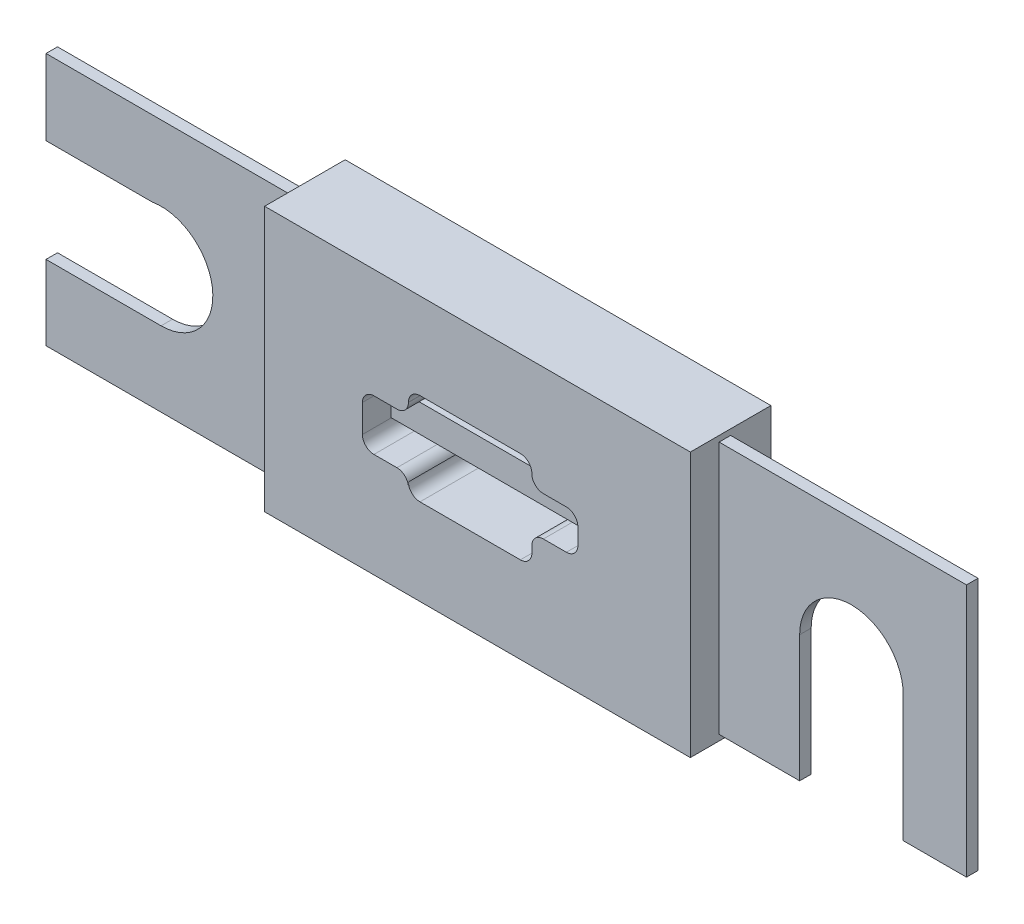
ISO-10303-21;
HEADER;
FILE_DESCRIPTION(('STEP AP214'),'2;1');
FILE_NAME('part.step','',(''),(''),'','','');
FILE_SCHEMA(('AUTOMOTIVE_DESIGN { 1 0 10303 214 1 1 1 1 }'));
ENDSEC;
DATA;
#1=APPLICATION_CONTEXT('core data for automotive mechanical design processes');
#2=APPLICATION_PROTOCOL_DEFINITION('international standard','automotive_design',2000,#1);
#3=PRODUCT_CONTEXT('',#1,'mechanical');
#4=PRODUCT('Part','Part','',(#3));
#5=PRODUCT_RELATED_PRODUCT_CATEGORY('part','',(#4));
#6=PRODUCT_DEFINITION_FORMATION('','',#4);
#7=PRODUCT_DEFINITION_CONTEXT('part definition',#1,'design');
#8=PRODUCT_DEFINITION('design','',#6,#7);
#9=PRODUCT_DEFINITION_SHAPE('','',#8);
#10=(LENGTH_UNIT() NAMED_UNIT(*) SI_UNIT(.MILLI.,.METRE.));
#11=(NAMED_UNIT(*) PLANE_ANGLE_UNIT() SI_UNIT($,.RADIAN.));
#12=(NAMED_UNIT(*) SI_UNIT($,.STERADIAN.) SOLID_ANGLE_UNIT());
#13=UNCERTAINTY_MEASURE_WITH_UNIT(LENGTH_MEASURE(1.E-05),#10,'distance_accuracy_value','');
#14=(GEOMETRIC_REPRESENTATION_CONTEXT(3) GLOBAL_UNCERTAINTY_ASSIGNED_CONTEXT((#13)) GLOBAL_UNIT_ASSIGNED_CONTEXT((#10,
#11,#12)) REPRESENTATION_CONTEXT('',''));
#15=CARTESIAN_POINT('',(0.,0.,0.));
#16=DIRECTION('',(0.,0.,1.));
#17=DIRECTION('',(1.,0.,0.));
#18=AXIS2_PLACEMENT_3D('',#15,#16,#17);
#19=CARTESIAN_POINT('',(-10.,-11.,1.));
#20=DIRECTION('',(0.,1.,0.));
#21=DIRECTION('',(0.,0.,1.));
#22=AXIS2_PLACEMENT_3D('',#19,#20,#21);
#23=PLANE('',#22);
#24=DIRECTION('',(0.,0.,-1.));
#25=VECTOR('',#24,1.);
#26=CARTESIAN_POINT('',(11.5,-11.,1.));
#27=LINE('',#26,#25);
#28=CARTESIAN_POINT('',(11.5,-11.,1.));
#29=VERTEX_POINT('',#28);
#30=CARTESIAN_POINT('',(11.5,-11.,0.));
#31=VERTEX_POINT('',#30);
#32=EDGE_CURVE('E606',#29,#31,#27,.T.);
#33=ORIENTED_EDGE('',*,*,#32,.F.);
#34=DIRECTION('',(1.,0.,0.));
#35=VECTOR('',#34,1.);
#36=CARTESIAN_POINT('',(-10.,-11.,1.));
#37=LINE('',#36,#35);
#38=CARTESIAN_POINT('',(-10.,-11.,1.));
#39=VERTEX_POINT('',#38);
#40=EDGE_CURVE('E657',#39,#29,#37,.T.);
#41=ORIENTED_EDGE('',*,*,#40,.F.);
#42=DIRECTION('',(0.,0.,-1.));
#43=VECTOR('',#42,1.);
#44=CARTESIAN_POINT('',(-10.,-11.,1.));
#45=LINE('',#44,#43);
#46=CARTESIAN_POINT('',(-10.,-11.,0.));
#47=VERTEX_POINT('',#46);
#48=EDGE_CURVE('E702',#39,#47,#45,.T.);
#49=ORIENTED_EDGE('',*,*,#48,.T.);
#50=DIRECTION('',(1.,0.,0.));
#51=VECTOR('',#50,1.);
#52=CARTESIAN_POINT('',(-10.,-11.,0.));
#53=LINE('',#52,#51);
#54=EDGE_CURVE('E621',#47,#31,#53,.T.);
#55=ORIENTED_EDGE('',*,*,#54,.T.);
#56=EDGE_LOOP('',(#33,#41,#49,#55));
#57=FACE_BOUND('',#56,.T.);
#58=ADVANCED_FACE('F30',(#57),#23,.F.);
#59=CARTESIAN_POINT('',(-10.,11.,1.));
#60=DIRECTION('',(0.,-1.,0.));
#61=DIRECTION('',(0.,0.,-1.));
#62=AXIS2_PLACEMENT_3D('',#59,#60,#61);
#63=PLANE('',#62);
#64=DIRECTION('',(0.,0.,1.));
#65=VECTOR('',#64,1.);
#66=CARTESIAN_POINT('',(11.5,11.,1.));
#67=LINE('',#66,#65);
#68=CARTESIAN_POINT('',(11.5,11.,0.));
#69=VERTEX_POINT('',#68);
#70=CARTESIAN_POINT('',(11.5,11.,1.));
#71=VERTEX_POINT('',#70);
#72=EDGE_CURVE('E603',#69,#71,#67,.T.);
#73=ORIENTED_EDGE('',*,*,#72,.F.);
#74=DIRECTION('',(-1.,0.,0.));
#75=VECTOR('',#74,1.);
#76=CARTESIAN_POINT('',(-10.,11.,0.));
#77=LINE('',#76,#75);
#78=CARTESIAN_POINT('',(-10.,11.,0.));
#79=VERTEX_POINT('',#78);
#80=EDGE_CURVE('E644',#69,#79,#77,.T.);
#81=ORIENTED_EDGE('',*,*,#80,.T.);
#82=DIRECTION('',(0.,0.,-1.));
#83=VECTOR('',#82,1.);
#84=CARTESIAN_POINT('',(-10.,11.,1.));
#85=LINE('',#84,#83);
#86=CARTESIAN_POINT('',(-10.,11.,1.));
#87=VERTEX_POINT('',#86);
#88=EDGE_CURVE('E681',#87,#79,#85,.T.);
#89=ORIENTED_EDGE('',*,*,#88,.F.);
#90=DIRECTION('',(-1.,0.,0.));
#91=VECTOR('',#90,1.);
#92=CARTESIAN_POINT('',(-10.,11.,1.));
#93=LINE('',#92,#91);
#94=EDGE_CURVE('E679',#71,#87,#93,.T.);
#95=ORIENTED_EDGE('',*,*,#94,.F.);
#96=EDGE_LOOP('',(#73,#81,#89,#95));
#97=FACE_BOUND('',#96,.T.);
#98=ADVANCED_FACE('F785',(#97),#63,.F.);
#99=CARTESIAN_POINT('',(0.,0.,1.));
#100=DIRECTION('',(0.,0.,1.));
#101=DIRECTION('',(1.,0.,0.));
#102=AXIS2_PLACEMENT_3D('',#99,#100,#101);
#103=PLANE('',#102);
#104=ORIENTED_EDGE('',*,*,#40,.T.);
#105=DIRECTION('',(0.,1.,0.));
#106=VECTOR('',#105,1.);
#107=CARTESIAN_POINT('',(11.5,0.,1.));
#108=LINE('',#107,#106);
#109=EDGE_CURVE('E45',#29,#71,#108,.T.);
#110=ORIENTED_EDGE('',*,*,#109,.T.);
#111=ORIENTED_EDGE('',*,*,#94,.T.);
#112=DIRECTION('',(0.,-1.,0.));
#113=VECTOR('',#112,1.);
#114=CARTESIAN_POINT('',(-10.,11.,1.));
#115=LINE('',#114,#113);
#116=CARTESIAN_POINT('',(-10.,4.43383161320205,1.));
#117=VERTEX_POINT('',#116);
#118=EDGE_CURVE('E646',#87,#117,#115,.T.);
#119=ORIENTED_EDGE('',*,*,#118,.T.);
#120=DIRECTION('',(1.,0.,0.));
#121=VECTOR('',#120,1.);
#122=CARTESIAN_POINT('',(-10.,4.43383161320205,1.));
#123=LINE('',#122,#121);
#124=CARTESIAN_POINT('',(-0.768854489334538,4.43383161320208,1.));
#125=VERTEX_POINT('',#124);
#126=EDGE_CURVE('E649',#117,#125,#123,.T.);
#127=ORIENTED_EDGE('',*,*,#126,.T.);
#128=CARTESIAN_POINT('',(0.,0.,1.));
#129=DIRECTION('',(0.,0.,-1.));
#130=DIRECTION('',(1.,0.,0.));
#131=AXIS2_PLACEMENT_3D('',#128,#129,#130);
#132=CIRCLE('',#131,4.5);
#133=CARTESIAN_POINT('',(0.,-4.5,1.));
#134=VERTEX_POINT('',#133);
#135=EDGE_CURVE('E651',#125,#134,#132,.T.);
#136=ORIENTED_EDGE('',*,*,#135,.T.);
#137=DIRECTION('',(-1.,0.,0.));
#138=VECTOR('',#137,1.);
#139=CARTESIAN_POINT('',(0.,-4.5,1.));
#140=LINE('',#139,#138);
#141=CARTESIAN_POINT('',(-10.,-4.49999999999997,1.));
#142=VERTEX_POINT('',#141);
#143=EDGE_CURVE('E653',#134,#142,#140,.T.);
#144=ORIENTED_EDGE('',*,*,#143,.T.);
#145=DIRECTION('',(0.,-1.,0.));
#146=VECTOR('',#145,1.);
#147=CARTESIAN_POINT('',(-10.,-4.49999999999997,1.));
#148=LINE('',#147,#146);
#149=EDGE_CURVE('E655',#142,#39,#148,.T.);
#150=ORIENTED_EDGE('',*,*,#149,.T.);
#151=EDGE_LOOP('',(#104,#110,#111,#119,#127,#136,#144,#150));
#152=FACE_BOUND('',#151,.T.);
#153=ADVANCED_FACE('F772',(#152),#103,.T.);
#154=CARTESIAN_POINT('',(0.,0.,0.));
#155=DIRECTION('',(0.,0.,1.));
#156=DIRECTION('',(1.,0.,0.));
#157=AXIS2_PLACEMENT_3D('',#154,#155,#156);
#158=PLANE('',#157);
#159=DIRECTION('',(0.,1.,0.));
#160=VECTOR('',#159,1.);
#161=CARTESIAN_POINT('',(11.5,0.,0.));
#162=LINE('',#161,#160);
#163=EDGE_CURVE('E11',#31,#69,#162,.T.);
#164=ORIENTED_EDGE('',*,*,#163,.F.);
#165=ORIENTED_EDGE('',*,*,#54,.F.);
#166=DIRECTION('',(0.,-1.,0.));
#167=VECTOR('',#166,1.);
#168=CARTESIAN_POINT('',(-10.,-4.49999999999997,0.));
#169=LINE('',#168,#167);
#170=CARTESIAN_POINT('',(-10.,-4.49999999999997,0.));
#171=VERTEX_POINT('',#170);
#172=EDGE_CURVE('E619',#171,#47,#169,.T.);
#173=ORIENTED_EDGE('',*,*,#172,.F.);
#174=DIRECTION('',(-1.,0.,0.));
#175=VECTOR('',#174,1.);
#176=CARTESIAN_POINT('',(0.,-4.5,0.));
#177=LINE('',#176,#175);
#178=CARTESIAN_POINT('',(0.,-4.5,0.));
#179=VERTEX_POINT('',#178);
#180=EDGE_CURVE('E617',#179,#171,#177,.T.);
#181=ORIENTED_EDGE('',*,*,#180,.F.);
#182=CARTESIAN_POINT('',(0.,0.,0.));
#183=DIRECTION('',(0.,0.,-1.));
#184=DIRECTION('',(1.,0.,0.));
#185=AXIS2_PLACEMENT_3D('',#182,#183,#184);
#186=CIRCLE('',#185,4.5);
#187=CARTESIAN_POINT('',(-0.768854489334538,4.43383161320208,0.));
#188=VERTEX_POINT('',#187);
#189=EDGE_CURVE('E615',#188,#179,#186,.T.);
#190=ORIENTED_EDGE('',*,*,#189,.F.);
#191=DIRECTION('',(1.,0.,0.));
#192=VECTOR('',#191,1.);
#193=CARTESIAN_POINT('',(-10.,4.43383161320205,0.));
#194=LINE('',#193,#192);
#195=CARTESIAN_POINT('',(-10.,4.43383161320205,0.));
#196=VERTEX_POINT('',#195);
#197=EDGE_CURVE('E613',#196,#188,#194,.T.);
#198=ORIENTED_EDGE('',*,*,#197,.F.);
#199=DIRECTION('',(0.,-1.,0.));
#200=VECTOR('',#199,1.);
#201=CARTESIAN_POINT('',(-10.,11.,0.));
#202=LINE('',#201,#200);
#203=EDGE_CURVE('E610',#79,#196,#202,.T.);
#204=ORIENTED_EDGE('',*,*,#203,.F.);
#205=ORIENTED_EDGE('',*,*,#80,.F.);
#206=EDGE_LOOP('',(#164,#165,#173,#181,#190,#198,#204,#205));
#207=FACE_BOUND('',#206,.T.);
#208=ADVANCED_FACE('F780',(#207),#158,.F.);
#209=CARTESIAN_POINT('',(-10.,11.,1.));
#210=DIRECTION('',(1.,0.,0.));
#211=DIRECTION('',(0.,1.,0.));
#212=AXIS2_PLACEMENT_3D('',#209,#210,#211);
#213=PLANE('',#212);
#214=ORIENTED_EDGE('',*,*,#203,.T.);
#215=DIRECTION('',(0.,0.,-1.));
#216=VECTOR('',#215,1.);
#217=CARTESIAN_POINT('',(-10.,4.43383161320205,1.));
#218=LINE('',#217,#216);
#219=EDGE_CURVE('E714',#117,#196,#218,.T.);
#220=ORIENTED_EDGE('',*,*,#219,.F.);
#221=ORIENTED_EDGE('',*,*,#118,.F.);
#222=ORIENTED_EDGE('',*,*,#88,.T.);
#223=EDGE_LOOP('',(#214,#220,#221,#222));
#224=FACE_BOUND('',#223,.T.);
#225=ADVANCED_FACE('F32',(#224),#213,.F.);
#226=CARTESIAN_POINT('',(-10.,4.43383161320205,1.));
#227=DIRECTION('',(0.,1.,0.));
#228=DIRECTION('',(-1.,0.,0.));
#229=AXIS2_PLACEMENT_3D('',#226,#227,#228);
#230=PLANE('',#229);
#231=ORIENTED_EDGE('',*,*,#197,.T.);
#232=DIRECTION('',(0.,0.,-1.));
#233=VECTOR('',#232,1.);
#234=CARTESIAN_POINT('',(-0.768854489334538,4.43383161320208,1.));
#235=LINE('',#234,#233);
#236=EDGE_CURVE('E711',#125,#188,#235,.T.);
#237=ORIENTED_EDGE('',*,*,#236,.F.);
#238=ORIENTED_EDGE('',*,*,#126,.F.);
#239=ORIENTED_EDGE('',*,*,#219,.T.);
#240=EDGE_LOOP('',(#231,#237,#238,#239));
#241=FACE_BOUND('',#240,.T.);
#242=ADVANCED_FACE('F808',(#241),#230,.F.);
#243=CARTESIAN_POINT('',(0.,0.,1.));
#244=DIRECTION('',(0.,0.,-1.));
#245=DIRECTION('',(-1.,0.,0.));
#246=AXIS2_PLACEMENT_3D('',#243,#244,#245);
#247=CYLINDRICAL_SURFACE('',#246,4.5);
#248=ORIENTED_EDGE('',*,*,#189,.T.);
#249=DIRECTION('',(0.,0.,-1.));
#250=VECTOR('',#249,1.);
#251=CARTESIAN_POINT('',(0.,-4.5,1.));
#252=LINE('',#251,#250);
#253=EDGE_CURVE('E708',#134,#179,#252,.T.);
#254=ORIENTED_EDGE('',*,*,#253,.F.);
#255=ORIENTED_EDGE('',*,*,#135,.F.);
#256=ORIENTED_EDGE('',*,*,#236,.T.);
#257=EDGE_LOOP('',(#248,#254,#255,#256));
#258=FACE_BOUND('',#257,.T.);
#259=ADVANCED_FACE('F805',(#258),#247,.F.);
#260=CARTESIAN_POINT('',(0.,-4.5,1.));
#261=DIRECTION('',(0.,-1.,0.));
#262=DIRECTION('',(1.,0.,0.));
#263=AXIS2_PLACEMENT_3D('',#260,#261,#262);
#264=PLANE('',#263);
#265=ORIENTED_EDGE('',*,*,#180,.T.);
#266=DIRECTION('',(0.,0.,-1.));
#267=VECTOR('',#266,1.);
#268=CARTESIAN_POINT('',(-10.,-4.49999999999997,1.));
#269=LINE('',#268,#267);
#270=EDGE_CURVE('E705',#142,#171,#269,.T.);
#271=ORIENTED_EDGE('',*,*,#270,.F.);
#272=ORIENTED_EDGE('',*,*,#143,.F.);
#273=ORIENTED_EDGE('',*,*,#253,.T.);
#274=EDGE_LOOP('',(#265,#271,#272,#273));
#275=FACE_BOUND('',#274,.T.);
#276=ADVANCED_FACE('F801',(#275),#264,.F.);
#277=CARTESIAN_POINT('',(-10.,-4.49999999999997,1.));
#278=DIRECTION('',(1.,0.,0.));
#279=DIRECTION('',(0.,1.,0.));
#280=AXIS2_PLACEMENT_3D('',#277,#278,#279);
#281=PLANE('',#280);
#282=ORIENTED_EDGE('',*,*,#172,.T.);
#283=ORIENTED_EDGE('',*,*,#48,.F.);
#284=ORIENTED_EDGE('',*,*,#149,.F.);
#285=ORIENTED_EDGE('',*,*,#270,.T.);
#286=EDGE_LOOP('',(#282,#283,#284,#285));
#287=FACE_BOUND('',#286,.T.);
#288=ADVANCED_FACE('F797',(#287),#281,.F.);
#289=CARTESIAN_POINT('',(38.7261606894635,0.98139653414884,3.5));
#290=DIRECTION('',(-1.,0.,0.));
#291=DIRECTION('',(0.,-1.,0.));
#292=AXIS2_PLACEMENT_3D('',#289,#290,#291);
#293=PLANE('',#292);
#294=DIRECTION('',(0.,-1.,0.));
#295=VECTOR('',#294,1.);
#296=CARTESIAN_POINT('',(38.7261606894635,1.90432923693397E-13,0.));
#297=LINE('',#296,#295);
#298=CARTESIAN_POINT('',(38.7261606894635,0.981396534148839,0.));
#299=VERTEX_POINT('',#298);
#300=CARTESIAN_POINT('',(38.7261606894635,-0.429686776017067,0.));
#301=VERTEX_POINT('',#300);
#302=EDGE_CURVE('E720',#299,#301,#297,.T.);
#303=ORIENTED_EDGE('',*,*,#302,.F.);
#304=DIRECTION('',(0.,0.,-1.));
#305=VECTOR('',#304,1.);
#306=CARTESIAN_POINT('',(38.7261606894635,0.98139653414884,3.5));
#307=LINE('',#306,#305);
#308=CARTESIAN_POINT('',(38.7261606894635,0.98139653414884,-3.5));
#309=VERTEX_POINT('',#308);
#310=EDGE_CURVE('E516',#299,#309,#307,.T.);
#311=ORIENTED_EDGE('',*,*,#310,.T.);
#312=DIRECTION('',(0.,1.,0.));
#313=VECTOR('',#312,1.);
#314=CARTESIAN_POINT('',(38.7261606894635,0.98139653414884,-3.5));
#315=LINE('',#314,#313);
#316=CARTESIAN_POINT('',(38.7261606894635,-0.429686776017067,-3.5));
#317=VERTEX_POINT('',#316);
#318=EDGE_CURVE('E417',#317,#309,#315,.T.);
#319=ORIENTED_EDGE('',*,*,#318,.F.);
#320=DIRECTION('',(0.,0.,-1.));
#321=VECTOR('',#320,1.);
#322=CARTESIAN_POINT('',(38.7261606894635,-0.429686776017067,3.5));
#323=LINE('',#322,#321);
#324=EDGE_CURVE('E520',#301,#317,#323,.T.);
#325=ORIENTED_EDGE('',*,*,#324,.F.);
#326=EDGE_LOOP('',(#303,#311,#319,#325));
#327=FACE_BOUND('',#326,.T.);
#328=ADVANCED_FACE('F800',(#327),#293,.T.);
#329=CARTESIAN_POINT('',(11.5,-11.5,3.5));
#330=DIRECTION('',(0.,0.,1.));
#331=DIRECTION('',(1.,0.,0.));
#332=AXIS2_PLACEMENT_3D('',#329,#330,#331);
#333=PLANE('',#332);
#334=DIRECTION('',(0.,-1.,0.));
#335=VECTOR('',#334,1.);
#336=CARTESIAN_POINT('',(11.5,11.5,3.5));
#337=LINE('',#336,#335);
#338=CARTESIAN_POINT('',(11.5,11.5,3.5));
#339=VERTEX_POINT('',#338);
#340=CARTESIAN_POINT('',(11.5,-11.5,3.5));
#341=VERTEX_POINT('',#340);
#342=EDGE_CURVE('E554',#339,#341,#337,.T.);
#343=ORIENTED_EDGE('',*,*,#342,.T.);
#344=DIRECTION('',(1.,0.,0.));
#345=VECTOR('',#344,1.);
#346=CARTESIAN_POINT('',(11.5,-11.5,3.5));
#347=LINE('',#346,#345);
#348=CARTESIAN_POINT('',(48.5,-11.5,3.5));
#349=VERTEX_POINT('',#348);
#350=EDGE_CURVE('E557',#341,#349,#347,.T.);
#351=ORIENTED_EDGE('',*,*,#350,.T.);
#352=DIRECTION('',(0.,1.,0.));
#353=VECTOR('',#352,1.);
#354=CARTESIAN_POINT('',(48.5,11.5,3.5));
#355=LINE('',#354,#353);
#356=CARTESIAN_POINT('',(48.5,11.5,3.5));
#357=VERTEX_POINT('',#356);
#358=EDGE_CURVE('E559',#349,#357,#355,.T.);
#359=ORIENTED_EDGE('',*,*,#358,.T.);
#360=DIRECTION('',(-1.,0.,0.));
#361=VECTOR('',#360,1.);
#362=CARTESIAN_POINT('',(11.5,11.5,3.5));
#363=LINE('',#362,#361);
#364=EDGE_CURVE('E561',#357,#339,#363,.T.);
#365=ORIENTED_EDGE('',*,*,#364,.T.);
#366=EDGE_LOOP('',(#343,#351,#359,#365));
#367=FACE_BOUND('',#366,.T.);
#368=DIRECTION('',(0.,-1.,0.));
#369=VECTOR('',#368,1.);
#370=CARTESIAN_POINT('',(20.,0.981396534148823,3.5));
#371=LINE('',#370,#369);
#372=CARTESIAN_POINT('',(20.,0.981396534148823,3.5));
#373=VERTEX_POINT('',#372);
#374=CARTESIAN_POINT('',(20.,-1.42968677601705,3.5));
#375=VERTEX_POINT('',#374);
#376=EDGE_CURVE('E449',#373,#375,#371,.T.);
#377=ORIENTED_EDGE('',*,*,#376,.F.);
#378=CARTESIAN_POINT('',(21.,0.98139653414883,3.5));
#379=DIRECTION('',(0.,0.,1.));
#380=DIRECTION('',(-1.,0.,0.));
#381=AXIS2_PLACEMENT_3D('',#378,#379,#380);
#382=CIRCLE('',#381,1.);
#383=CARTESIAN_POINT('',(21.,1.98139653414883,3.5));
#384=VERTEX_POINT('',#383);
#385=EDGE_CURVE('E447',#384,#373,#382,.T.);
#386=ORIENTED_EDGE('',*,*,#385,.F.);
#387=DIRECTION('',(-1.,0.,0.));
#388=VECTOR('',#387,1.);
#389=CARTESIAN_POINT('',(21.,1.98139653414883,3.5));
#390=LINE('',#389,#388);
#391=CARTESIAN_POINT('',(23.,1.98139653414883,3.5));
#392=VERTEX_POINT('',#391);
#393=EDGE_CURVE('E494',#392,#384,#390,.T.);
#394=ORIENTED_EDGE('',*,*,#393,.F.);
#395=CARTESIAN_POINT('',(23.,2.98139653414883,3.5));
#396=DIRECTION('',(0.,0.,-1.));
#397=DIRECTION('',(1.,0.,0.));
#398=AXIS2_PLACEMENT_3D('',#395,#396,#397);
#399=CIRCLE('',#398,0.999999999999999);
#400=CARTESIAN_POINT('',(24.,2.98139653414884,3.5));
#401=VERTEX_POINT('',#400);
#402=EDGE_CURVE('E491',#401,#392,#399,.T.);
#403=ORIENTED_EDGE('',*,*,#402,.F.);
#404=DIRECTION('',(0.,-1.,0.));
#405=VECTOR('',#404,1.);
#406=CARTESIAN_POINT('',(24.,2.98139653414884,3.5));
#407=LINE('',#406,#405);
#408=CARTESIAN_POINT('',(24.,3.,3.5));
#409=VERTEX_POINT('',#408);
#410=EDGE_CURVE('E489',#409,#401,#407,.T.);
#411=ORIENTED_EDGE('',*,*,#410,.F.);
#412=CARTESIAN_POINT('',(25.,3.,3.5));
#413=DIRECTION('',(0.,0.,1.));
#414=DIRECTION('',(1.,0.,0.));
#415=AXIS2_PLACEMENT_3D('',#412,#413,#414);
#416=CIRCLE('',#415,1.);
#417=CARTESIAN_POINT('',(25.,4.,3.5));
#418=VERTEX_POINT('',#417);
#419=EDGE_CURVE('E487',#418,#409,#416,.T.);
#420=ORIENTED_EDGE('',*,*,#419,.F.);
#421=DIRECTION('',(-1.,0.,0.));
#422=VECTOR('',#421,1.);
#423=CARTESIAN_POINT('',(25.,4.,3.5));
#424=LINE('',#423,#422);
#425=CARTESIAN_POINT('',(33.7261606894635,4.,3.5));
#426=VERTEX_POINT('',#425);
#427=EDGE_CURVE('E485',#426,#418,#424,.T.);
#428=ORIENTED_EDGE('',*,*,#427,.F.);
#429=CARTESIAN_POINT('',(33.7261606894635,3.,3.5));
#430=DIRECTION('',(0.,0.,1.));
#431=DIRECTION('',(1.,0.,0.));
#432=AXIS2_PLACEMENT_3D('',#429,#430,#431);
#433=CIRCLE('',#432,1.);
#434=CARTESIAN_POINT('',(34.7261606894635,3.00000000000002,3.5));
#435=VERTEX_POINT('',#434);
#436=EDGE_CURVE('E483',#435,#426,#433,.T.);
#437=ORIENTED_EDGE('',*,*,#436,.F.);
#438=DIRECTION('',(-1.8649465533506E-12,1.,0.));
#439=VECTOR('',#438,1.);
#440=CARTESIAN_POINT('',(34.7261606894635,3.00000000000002,3.5));
#441=LINE('',#440,#439);
#442=CARTESIAN_POINT('',(34.7261606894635,2.98139653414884,3.5));
#443=VERTEX_POINT('',#442);
#444=EDGE_CURVE('E481',#443,#435,#441,.T.);
#445=ORIENTED_EDGE('',*,*,#444,.F.);
#446=CARTESIAN_POINT('',(35.7261606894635,2.98139653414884,3.5));
#447=DIRECTION('',(0.,0.,-1.));
#448=DIRECTION('',(-1.,0.,0.));
#449=AXIS2_PLACEMENT_3D('',#446,#447,#448);
#450=CIRCLE('',#449,1.);
#451=CARTESIAN_POINT('',(35.7261606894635,1.98139653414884,3.5));
#452=VERTEX_POINT('',#451);
#453=EDGE_CURVE('E479',#452,#443,#450,.T.);
#454=ORIENTED_EDGE('',*,*,#453,.F.);
#455=DIRECTION('',(-1.,0.,0.));
#456=VECTOR('',#455,1.);
#457=CARTESIAN_POINT('',(35.7261606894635,1.98139653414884,3.5));
#458=LINE('',#457,#456);
#459=CARTESIAN_POINT('',(37.7261606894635,1.98139653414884,3.5));
#460=VERTEX_POINT('',#459);
#461=EDGE_CURVE('E477',#460,#452,#458,.T.);
#462=ORIENTED_EDGE('',*,*,#461,.F.);
#463=CARTESIAN_POINT('',(37.7261606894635,0.981396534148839,3.5));
#464=DIRECTION('',(0.,0.,1.));
#465=DIRECTION('',(1.,0.,0.));
#466=AXIS2_PLACEMENT_3D('',#463,#464,#465);
#467=CIRCLE('',#466,1.);
#468=CARTESIAN_POINT('',(38.7261606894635,0.98139653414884,3.5));
#469=VERTEX_POINT('',#468);
#470=EDGE_CURVE('E475',#469,#460,#467,.T.);
#471=ORIENTED_EDGE('',*,*,#470,.F.);
#472=DIRECTION('',(0.,1.,0.));
#473=VECTOR('',#472,1.);
#474=CARTESIAN_POINT('',(38.7261606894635,0.98139653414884,3.5));
#475=LINE('',#474,#473);
#476=CARTESIAN_POINT('',(38.7261606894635,-0.429686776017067,3.5));
#477=VERTEX_POINT('',#476);
#478=EDGE_CURVE('E473',#477,#469,#475,.T.);
#479=ORIENTED_EDGE('',*,*,#478,.F.);
#480=CARTESIAN_POINT('',(37.7261606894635,-0.429686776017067,3.5));
#481=DIRECTION('',(0.,0.,1.));
#482=DIRECTION('',(1.,0.,0.));
#483=AXIS2_PLACEMENT_3D('',#480,#481,#482);
#484=CIRCLE('',#483,1.00000000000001);
#485=CARTESIAN_POINT('',(37.7261606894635,-1.42968677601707,3.5));
#486=VERTEX_POINT('',#485);
#487=EDGE_CURVE('E471',#486,#477,#484,.T.);
#488=ORIENTED_EDGE('',*,*,#487,.F.);
#489=DIRECTION('',(1.,0.,0.));
#490=VECTOR('',#489,1.);
#491=CARTESIAN_POINT('',(35.7261606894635,-1.42968677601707,3.5));
#492=LINE('',#491,#490);
#493=CARTESIAN_POINT('',(35.7261606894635,-1.42968677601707,3.5));
#494=VERTEX_POINT('',#493);
#495=EDGE_CURVE('E469',#494,#486,#492,.T.);
#496=ORIENTED_EDGE('',*,*,#495,.F.);
#497=CARTESIAN_POINT('',(35.7261606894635,-2.42968677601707,3.5));
#498=DIRECTION('',(0.,0.,-1.));
#499=DIRECTION('',(-1.,0.,0.));
#500=AXIS2_PLACEMENT_3D('',#497,#498,#499);
#501=CIRCLE('',#500,1.);
#502=CARTESIAN_POINT('',(34.7261606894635,-2.42968677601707,3.5));
#503=VERTEX_POINT('',#502);
#504=EDGE_CURVE('E467',#503,#494,#501,.T.);
#505=ORIENTED_EDGE('',*,*,#504,.F.);
#506=DIRECTION('',(0.,1.,0.));
#507=VECTOR('',#506,1.);
#508=CARTESIAN_POINT('',(34.7261606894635,-2.42968677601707,3.5));
#509=LINE('',#508,#507);
#510=CARTESIAN_POINT('',(34.7261606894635,-3.,3.5));
#511=VERTEX_POINT('',#510);
#512=EDGE_CURVE('E465',#511,#503,#509,.T.);
#513=ORIENTED_EDGE('',*,*,#512,.F.);
#514=CARTESIAN_POINT('',(33.7261606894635,-3.,3.5));
#515=DIRECTION('',(0.,0.,1.));
#516=DIRECTION('',(-1.,0.,0.));
#517=AXIS2_PLACEMENT_3D('',#514,#515,#516);
#518=CIRCLE('',#517,1.);
#519=CARTESIAN_POINT('',(33.7261606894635,-4.,3.5));
#520=VERTEX_POINT('',#519);
#521=EDGE_CURVE('E463',#520,#511,#518,.T.);
#522=ORIENTED_EDGE('',*,*,#521,.F.);
#523=DIRECTION('',(1.,0.,0.));
#524=VECTOR('',#523,1.);
#525=CARTESIAN_POINT('',(25.,-4.,3.5));
#526=LINE('',#525,#524);
#527=CARTESIAN_POINT('',(25.,-4.,3.5));
#528=VERTEX_POINT('',#527);
#529=EDGE_CURVE('E461',#528,#520,#526,.T.);
#530=ORIENTED_EDGE('',*,*,#529,.F.);
#531=CARTESIAN_POINT('',(25.,-3.,3.5));
#532=DIRECTION('',(0.,0.,1.));
#533=DIRECTION('',(-1.,0.,0.));
#534=AXIS2_PLACEMENT_3D('',#531,#532,#533);
#535=CIRCLE('',#534,1.);
#536=CARTESIAN_POINT('',(24.,-3.,3.5));
#537=VERTEX_POINT('',#536);
#538=EDGE_CURVE('E459',#537,#528,#535,.T.);
#539=ORIENTED_EDGE('',*,*,#538,.F.);
#540=DIRECTION('',(0.,1.,0.));
#541=VECTOR('',#540,1.);
#542=CARTESIAN_POINT('',(24.,-3.42968677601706,3.5));
#543=LINE('',#542,#541);
#544=CARTESIAN_POINT('',(24.,-3.42968677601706,3.5));
#545=VERTEX_POINT('',#544);
#546=EDGE_CURVE('E457',#545,#537,#543,.T.);
#547=ORIENTED_EDGE('',*,*,#546,.F.);
#548=CARTESIAN_POINT('',(23.,-3.42968677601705,3.5));
#549=DIRECTION('',(0.,0.,-1.));
#550=DIRECTION('',(1.,0.,0.));
#551=AXIS2_PLACEMENT_3D('',#548,#549,#550);
#552=CIRCLE('',#551,1.);
#553=CARTESIAN_POINT('',(23.,-2.42968677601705,3.5));
#554=VERTEX_POINT('',#553);
#555=EDGE_CURVE('E455',#554,#545,#552,.T.);
#556=ORIENTED_EDGE('',*,*,#555,.F.);
#557=DIRECTION('',(1.,0.,0.));
#558=VECTOR('',#557,1.);
#559=CARTESIAN_POINT('',(21.,-2.42968677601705,3.5));
#560=LINE('',#559,#558);
#561=CARTESIAN_POINT('',(21.,-2.42968677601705,3.5));
#562=VERTEX_POINT('',#561);
#563=EDGE_CURVE('E453',#562,#554,#560,.T.);
#564=ORIENTED_EDGE('',*,*,#563,.F.);
#565=CARTESIAN_POINT('',(21.,-1.42968677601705,3.5));
#566=DIRECTION('',(0.,0.,1.));
#567=DIRECTION('',(-1.,0.,0.));
#568=AXIS2_PLACEMENT_3D('',#565,#566,#567);
#569=CIRCLE('',#568,1.);
#570=EDGE_CURVE('E451',#375,#562,#569,.T.);
#571=ORIENTED_EDGE('',*,*,#570,.F.);
#572=EDGE_LOOP('',(#377,#386,#394,#403,#411,#420,#428,#437,#445,#454,#462,#471,#479,#488,#496,
#505,#513,#522,#530,#539,#547,#556,#564,#571));
#573=FACE_BOUND('',#572,.T.);
#574=ADVANCED_FACE('F851',(#367,#573),#333,.T.);
#575=CARTESIAN_POINT('',(11.5,-11.5,-3.5));
#576=DIRECTION('',(0.,0.,1.));
#577=DIRECTION('',(1.,0.,0.));
#578=AXIS2_PLACEMENT_3D('',#575,#576,#577);
#579=PLANE('',#578);
#580=DIRECTION('',(0.,-1.,0.));
#581=VECTOR('',#580,1.);
#582=CARTESIAN_POINT('',(11.5,11.5,-3.5));
#583=LINE('',#582,#581);
#584=CARTESIAN_POINT('',(11.5,11.5,-3.5));
#585=VERTEX_POINT('',#584);
#586=CARTESIAN_POINT('',(11.5,-11.5,-3.5));
#587=VERTEX_POINT('',#586);
#588=EDGE_CURVE('E545',#585,#587,#583,.T.);
#589=ORIENTED_EDGE('',*,*,#588,.F.);
#590=DIRECTION('',(-1.,0.,0.));
#591=VECTOR('',#590,1.);
#592=CARTESIAN_POINT('',(11.5,11.5,-3.5));
#593=LINE('',#592,#591);
#594=CARTESIAN_POINT('',(48.5,11.5,-3.5));
#595=VERTEX_POINT('',#594);
#596=EDGE_CURVE('E552',#595,#585,#593,.T.);
#597=ORIENTED_EDGE('',*,*,#596,.F.);
#598=DIRECTION('',(0.,1.,0.));
#599=VECTOR('',#598,1.);
#600=CARTESIAN_POINT('',(48.5,11.5,-3.5));
#601=LINE('',#600,#599);
#602=CARTESIAN_POINT('',(48.5,-11.5,-3.5));
#603=VERTEX_POINT('',#602);
#604=EDGE_CURVE('E550',#603,#595,#601,.T.);
#605=ORIENTED_EDGE('',*,*,#604,.F.);
#606=DIRECTION('',(1.,0.,0.));
#607=VECTOR('',#606,1.);
#608=CARTESIAN_POINT('',(11.5,-11.5,-3.5));
#609=LINE('',#608,#607);
#610=EDGE_CURVE('E548',#587,#603,#609,.T.);
#611=ORIENTED_EDGE('',*,*,#610,.F.);
#612=EDGE_LOOP('',(#589,#597,#605,#611));
#613=FACE_BOUND('',#612,.T.);
#614=CARTESIAN_POINT('',(21.,0.98139653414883,-3.5));
#615=DIRECTION('',(0.,0.,1.));
#616=DIRECTION('',(-1.,0.,0.));
#617=AXIS2_PLACEMENT_3D('',#614,#615,#616);
#618=CIRCLE('',#617,1.);
#619=CARTESIAN_POINT('',(21.,1.98139653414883,-3.5));
#620=VERTEX_POINT('',#619);
#621=CARTESIAN_POINT('',(20.,0.981396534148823,-3.5));
#622=VERTEX_POINT('',#621);
#623=EDGE_CURVE('E361',#620,#622,#618,.T.);
#624=ORIENTED_EDGE('',*,*,#623,.T.);
#625=DIRECTION('',(0.,-1.,0.));
#626=VECTOR('',#625,1.);
#627=CARTESIAN_POINT('',(20.,0.981396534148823,-3.5));
#628=LINE('',#627,#626);
#629=CARTESIAN_POINT('',(20.,-1.42968677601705,-3.5));
#630=VERTEX_POINT('',#629);
#631=EDGE_CURVE('E371',#622,#630,#628,.T.);
#632=ORIENTED_EDGE('',*,*,#631,.T.);
#633=CARTESIAN_POINT('',(21.,-1.42968677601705,-3.5));
#634=DIRECTION('',(0.,0.,1.));
#635=DIRECTION('',(-1.,0.,0.));
#636=AXIS2_PLACEMENT_3D('',#633,#634,#635);
#637=CIRCLE('',#636,1.);
#638=CARTESIAN_POINT('',(21.,-2.42968677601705,-3.5));
#639=VERTEX_POINT('',#638);
#640=EDGE_CURVE('E377',#630,#639,#637,.T.);
#641=ORIENTED_EDGE('',*,*,#640,.T.);
#642=DIRECTION('',(1.,0.,0.));
#643=VECTOR('',#642,1.);
#644=CARTESIAN_POINT('',(21.,-2.42968677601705,-3.5));
#645=LINE('',#644,#643);
#646=CARTESIAN_POINT('',(23.,-2.42968677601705,-3.5));
#647=VERTEX_POINT('',#646);
#648=EDGE_CURVE('E387',#639,#647,#645,.T.);
#649=ORIENTED_EDGE('',*,*,#648,.T.);
#650=CARTESIAN_POINT('',(23.,-3.42968677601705,-3.5));
#651=DIRECTION('',(0.,0.,-1.));
#652=DIRECTION('',(1.,0.,0.));
#653=AXIS2_PLACEMENT_3D('',#650,#651,#652);
#654=CIRCLE('',#653,1.);
#655=CARTESIAN_POINT('',(24.,-3.42968677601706,-3.5));
#656=VERTEX_POINT('',#655);
#657=EDGE_CURVE('E390',#647,#656,#654,.T.);
#658=ORIENTED_EDGE('',*,*,#657,.T.);
#659=DIRECTION('',(0.,1.,0.));
#660=VECTOR('',#659,1.);
#661=CARTESIAN_POINT('',(24.,-3.42968677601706,-3.5));
#662=LINE('',#661,#660);
#663=CARTESIAN_POINT('',(24.,-3.,-3.5));
#664=VERTEX_POINT('',#663);
#665=EDGE_CURVE('E393',#656,#664,#662,.T.);
#666=ORIENTED_EDGE('',*,*,#665,.T.);
#667=CARTESIAN_POINT('',(25.,-3.,-3.5));
#668=DIRECTION('',(0.,0.,1.));
#669=DIRECTION('',(-1.,0.,0.));
#670=AXIS2_PLACEMENT_3D('',#667,#668,#669);
#671=CIRCLE('',#670,1.);
#672=CARTESIAN_POINT('',(25.,-4.,-3.5));
#673=VERTEX_POINT('',#672);
#674=EDGE_CURVE('E396',#664,#673,#671,.T.);
#675=ORIENTED_EDGE('',*,*,#674,.T.);
#676=DIRECTION('',(1.,0.,0.));
#677=VECTOR('',#676,1.);
#678=CARTESIAN_POINT('',(25.,-4.,-3.5));
#679=LINE('',#678,#677);
#680=CARTESIAN_POINT('',(33.7261606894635,-4.,-3.5));
#681=VERTEX_POINT('',#680);
#682=EDGE_CURVE('E399',#673,#681,#679,.T.);
#683=ORIENTED_EDGE('',*,*,#682,.T.);
#684=CARTESIAN_POINT('',(33.7261606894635,-3.,-3.5));
#685=DIRECTION('',(0.,0.,1.));
#686=DIRECTION('',(-1.,0.,0.));
#687=AXIS2_PLACEMENT_3D('',#684,#685,#686);
#688=CIRCLE('',#687,1.);
#689=CARTESIAN_POINT('',(34.7261606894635,-3.,-3.5));
#690=VERTEX_POINT('',#689);
#691=EDGE_CURVE('E402',#681,#690,#688,.T.);
#692=ORIENTED_EDGE('',*,*,#691,.T.);
#693=DIRECTION('',(0.,1.,0.));
#694=VECTOR('',#693,1.);
#695=CARTESIAN_POINT('',(34.7261606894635,-2.42968677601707,-3.5));
#696=LINE('',#695,#694);
#697=CARTESIAN_POINT('',(34.7261606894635,-2.42968677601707,-3.5));
#698=VERTEX_POINT('',#697);
#699=EDGE_CURVE('E405',#690,#698,#696,.T.);
#700=ORIENTED_EDGE('',*,*,#699,.T.);
#701=CARTESIAN_POINT('',(35.7261606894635,-2.42968677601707,-3.5));
#702=DIRECTION('',(0.,0.,-1.));
#703=DIRECTION('',(-1.,0.,0.));
#704=AXIS2_PLACEMENT_3D('',#701,#702,#703);
#705=CIRCLE('',#704,1.);
#706=CARTESIAN_POINT('',(35.7261606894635,-1.42968677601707,-3.5));
#707=VERTEX_POINT('',#706);
#708=EDGE_CURVE('E408',#698,#707,#705,.T.);
#709=ORIENTED_EDGE('',*,*,#708,.T.);
#710=DIRECTION('',(1.,0.,0.));
#711=VECTOR('',#710,1.);
#712=CARTESIAN_POINT('',(35.7261606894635,-1.42968677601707,-3.5));
#713=LINE('',#712,#711);
#714=CARTESIAN_POINT('',(37.7261606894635,-1.42968677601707,-3.5));
#715=VERTEX_POINT('',#714);
#716=EDGE_CURVE('E411',#707,#715,#713,.T.);
#717=ORIENTED_EDGE('',*,*,#716,.T.);
#718=CARTESIAN_POINT('',(37.7261606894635,-0.429686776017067,-3.5));
#719=DIRECTION('',(0.,0.,1.));
#720=DIRECTION('',(1.,0.,0.));
#721=AXIS2_PLACEMENT_3D('',#718,#719,#720);
#722=CIRCLE('',#721,1.00000000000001);
#723=EDGE_CURVE('E414',#715,#317,#722,.T.);
#724=ORIENTED_EDGE('',*,*,#723,.T.);
#725=ORIENTED_EDGE('',*,*,#318,.T.);
#726=CARTESIAN_POINT('',(37.7261606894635,0.981396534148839,-3.5));
#727=DIRECTION('',(0.,0.,1.));
#728=DIRECTION('',(1.,0.,0.));
#729=AXIS2_PLACEMENT_3D('',#726,#727,#728);
#730=CIRCLE('',#729,1.);
#731=CARTESIAN_POINT('',(37.7261606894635,1.98139653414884,-3.5));
#732=VERTEX_POINT('',#731);
#733=EDGE_CURVE('E420',#309,#732,#730,.T.);
#734=ORIENTED_EDGE('',*,*,#733,.T.);
#735=DIRECTION('',(-1.,0.,0.));
#736=VECTOR('',#735,1.);
#737=CARTESIAN_POINT('',(35.7261606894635,1.98139653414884,-3.5));
#738=LINE('',#737,#736);
#739=CARTESIAN_POINT('',(35.7261606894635,1.98139653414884,-3.5));
#740=VERTEX_POINT('',#739);
#741=EDGE_CURVE('E423',#732,#740,#738,.T.);
#742=ORIENTED_EDGE('',*,*,#741,.T.);
#743=CARTESIAN_POINT('',(35.7261606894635,2.98139653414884,-3.5));
#744=DIRECTION('',(0.,0.,-1.));
#745=DIRECTION('',(-1.,0.,0.));
#746=AXIS2_PLACEMENT_3D('',#743,#744,#745);
#747=CIRCLE('',#746,1.);
#748=CARTESIAN_POINT('',(34.7261606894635,2.98139653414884,-3.5));
#749=VERTEX_POINT('',#748);
#750=EDGE_CURVE('E426',#740,#749,#747,.T.);
#751=ORIENTED_EDGE('',*,*,#750,.T.);
#752=DIRECTION('',(-1.8649465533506E-12,1.,0.));
#753=VECTOR('',#752,1.);
#754=CARTESIAN_POINT('',(34.7261606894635,3.00000000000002,-3.5));
#755=LINE('',#754,#753);
#756=CARTESIAN_POINT('',(34.7261606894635,3.00000000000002,-3.5));
#757=VERTEX_POINT('',#756);
#758=EDGE_CURVE('E429',#749,#757,#755,.T.);
#759=ORIENTED_EDGE('',*,*,#758,.T.);
#760=CARTESIAN_POINT('',(33.7261606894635,3.,-3.5));
#761=DIRECTION('',(0.,0.,1.));
#762=DIRECTION('',(1.,0.,0.));
#763=AXIS2_PLACEMENT_3D('',#760,#761,#762);
#764=CIRCLE('',#763,1.);
#765=CARTESIAN_POINT('',(33.7261606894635,4.,-3.5));
#766=VERTEX_POINT('',#765);
#767=EDGE_CURVE('E432',#757,#766,#764,.T.);
#768=ORIENTED_EDGE('',*,*,#767,.T.);
#769=DIRECTION('',(-1.,0.,0.));
#770=VECTOR('',#769,1.);
#771=CARTESIAN_POINT('',(25.,4.,-3.5));
#772=LINE('',#771,#770);
#773=CARTESIAN_POINT('',(25.,4.,-3.5));
#774=VERTEX_POINT('',#773);
#775=EDGE_CURVE('E435',#766,#774,#772,.T.);
#776=ORIENTED_EDGE('',*,*,#775,.T.);
#777=CARTESIAN_POINT('',(25.,3.,-3.5));
#778=DIRECTION('',(0.,0.,1.));
#779=DIRECTION('',(1.,0.,0.));
#780=AXIS2_PLACEMENT_3D('',#777,#778,#779);
#781=CIRCLE('',#780,1.);
#782=CARTESIAN_POINT('',(24.,3.,-3.5));
#783=VERTEX_POINT('',#782);
#784=EDGE_CURVE('E438',#774,#783,#781,.T.);
#785=ORIENTED_EDGE('',*,*,#784,.T.);
#786=DIRECTION('',(0.,-1.,0.));
#787=VECTOR('',#786,1.);
#788=CARTESIAN_POINT('',(24.,2.98139653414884,-3.5));
#789=LINE('',#788,#787);
#790=CARTESIAN_POINT('',(24.,2.98139653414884,-3.5));
#791=VERTEX_POINT('',#790);
#792=EDGE_CURVE('E441',#783,#791,#789,.T.);
#793=ORIENTED_EDGE('',*,*,#792,.T.);
#794=CARTESIAN_POINT('',(23.,2.98139653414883,-3.5));
#795=DIRECTION('',(0.,0.,-1.));
#796=DIRECTION('',(1.,0.,0.));
#797=AXIS2_PLACEMENT_3D('',#794,#795,#796);
#798=CIRCLE('',#797,0.999999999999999);
#799=CARTESIAN_POINT('',(23.,1.98139653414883,-3.5));
#800=VERTEX_POINT('',#799);
#801=EDGE_CURVE('E444',#791,#800,#798,.T.);
#802=ORIENTED_EDGE('',*,*,#801,.T.);
#803=DIRECTION('',(-1.,0.,0.));
#804=VECTOR('',#803,1.);
#805=CARTESIAN_POINT('',(21.,1.98139653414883,-3.5));
#806=LINE('',#805,#804);
#807=EDGE_CURVE('E383',#800,#620,#806,.T.);
#808=ORIENTED_EDGE('',*,*,#807,.T.);
#809=EDGE_LOOP('',(#624,#632,#641,#649,#658,#666,#675,#683,#692,#700,#709,#717,#724,#725,#734,
#742,#751,#759,#768,#776,#785,#793,#802,#808));
#810=FACE_BOUND('',#809,.T.);
#811=ADVANCED_FACE('F380',(#613,#810),#579,.F.);
#812=CARTESIAN_POINT('',(11.5,11.5,3.5));
#813=DIRECTION('',(1.,0.,0.));
#814=DIRECTION('',(0.,0.,-1.));
#815=AXIS2_PLACEMENT_3D('',#812,#813,#814);
#816=PLANE('',#815);
#817=ORIENTED_EDGE('',*,*,#109,.F.);
#818=ORIENTED_EDGE('',*,*,#32,.T.);
#819=ORIENTED_EDGE('',*,*,#163,.T.);
#820=ORIENTED_EDGE('',*,*,#72,.T.);
#821=EDGE_LOOP('',(#817,#818,#819,#820));
#822=FACE_BOUND('',#821,.T.);
#823=ORIENTED_EDGE('',*,*,#588,.T.);
#824=DIRECTION('',(0.,0.,-1.));
#825=VECTOR('',#824,1.);
#826=CARTESIAN_POINT('',(11.5,-11.5,3.5));
#827=LINE('',#826,#825);
#828=EDGE_CURVE('E572',#341,#587,#827,.T.);
#829=ORIENTED_EDGE('',*,*,#828,.F.);
#830=ORIENTED_EDGE('',*,*,#342,.F.);
#831=DIRECTION('',(0.,0.,-1.));
#832=VECTOR('',#831,1.);
#833=CARTESIAN_POINT('',(11.5,11.5,3.5));
#834=LINE('',#833,#832);
#835=EDGE_CURVE('E563',#339,#585,#834,.T.);
#836=ORIENTED_EDGE('',*,*,#835,.T.);
#837=EDGE_LOOP('',(#823,#829,#830,#836));
#838=FACE_BOUND('',#837,.T.);
#839=ADVANCED_FACE('F835',(#822,#838),#816,.F.);
#840=CARTESIAN_POINT('',(11.5,-11.5,3.5));
#841=DIRECTION('',(0.,1.,0.));
#842=DIRECTION('',(0.,0.,1.));
#843=AXIS2_PLACEMENT_3D('',#840,#841,#842);
#844=PLANE('',#843);
#845=ORIENTED_EDGE('',*,*,#610,.T.);
#846=DIRECTION('',(0.,0.,-1.));
#847=VECTOR('',#846,1.);
#848=CARTESIAN_POINT('',(48.5,-11.5,3.5));
#849=LINE('',#848,#847);
#850=EDGE_CURVE('E569',#349,#603,#849,.T.);
#851=ORIENTED_EDGE('',*,*,#850,.F.);
#852=ORIENTED_EDGE('',*,*,#350,.F.);
#853=ORIENTED_EDGE('',*,*,#828,.T.);
#854=EDGE_LOOP('',(#845,#851,#852,#853));
#855=FACE_BOUND('',#854,.T.);
#856=ADVANCED_FACE('F838',(#855),#844,.F.);
#857=CARTESIAN_POINT('',(48.5,11.5,3.5));
#858=DIRECTION('',(-1.,0.,0.));
#859=DIRECTION('',(0.,0.,1.));
#860=AXIS2_PLACEMENT_3D('',#857,#858,#859);
#861=PLANE('',#860);
#862=DIRECTION('',(0.,-1.,0.));
#863=VECTOR('',#862,1.);
#864=CARTESIAN_POINT('',(48.5,0.,1.));
#865=LINE('',#864,#863);
#866=CARTESIAN_POINT('',(48.5,11.,1.));
#867=VERTEX_POINT('',#866);
#868=CARTESIAN_POINT('',(48.5,-11.,1.));
#869=VERTEX_POINT('',#868);
#870=EDGE_CURVE('E601',#867,#869,#865,.T.);
#871=ORIENTED_EDGE('',*,*,#870,.F.);
#872=DIRECTION('',(0.,0.,-1.));
#873=VECTOR('',#872,1.);
#874=CARTESIAN_POINT('',(48.5,11.,1.));
#875=LINE('',#874,#873);
#876=CARTESIAN_POINT('',(48.5,11.,0.));
#877=VERTEX_POINT('',#876);
#878=EDGE_CURVE('E53',#867,#877,#875,.T.);
#879=ORIENTED_EDGE('',*,*,#878,.T.);
#880=DIRECTION('',(0.,-1.,0.));
#881=VECTOR('',#880,1.);
#882=CARTESIAN_POINT('',(48.5,0.,0.));
#883=LINE('',#882,#881);
#884=CARTESIAN_POINT('',(48.5,-11.,0.));
#885=VERTEX_POINT('',#884);
#886=EDGE_CURVE('E38',#877,#885,#883,.T.);
#887=ORIENTED_EDGE('',*,*,#886,.T.);
#888=DIRECTION('',(0.,0.,1.));
#889=VECTOR('',#888,1.);
#890=CARTESIAN_POINT('',(48.5,-11.,1.));
#891=LINE('',#890,#889);
#892=EDGE_CURVE('E598',#885,#869,#891,.T.);
#893=ORIENTED_EDGE('',*,*,#892,.T.);
#894=EDGE_LOOP('',(#871,#879,#887,#893));
#895=FACE_BOUND('',#894,.T.);
#896=ORIENTED_EDGE('',*,*,#604,.T.);
#897=DIRECTION('',(0.,0.,-1.));
#898=VECTOR('',#897,1.);
#899=CARTESIAN_POINT('',(48.5,11.5,3.5));
#900=LINE('',#899,#898);
#901=EDGE_CURVE('E566',#357,#595,#900,.T.);
#902=ORIENTED_EDGE('',*,*,#901,.F.);
#903=ORIENTED_EDGE('',*,*,#358,.F.);
#904=ORIENTED_EDGE('',*,*,#850,.T.);
#905=EDGE_LOOP('',(#896,#902,#903,#904));
#906=FACE_BOUND('',#905,.T.);
#907=ADVANCED_FACE('F731',(#895,#906),#861,.F.);
#908=CARTESIAN_POINT('',(11.5,11.5,3.5));
#909=DIRECTION('',(0.,-1.,0.));
#910=DIRECTION('',(0.,0.,-1.));
#911=AXIS2_PLACEMENT_3D('',#908,#909,#910);
#912=PLANE('',#911);
#913=ORIENTED_EDGE('',*,*,#596,.T.);
#914=ORIENTED_EDGE('',*,*,#835,.F.);
#915=ORIENTED_EDGE('',*,*,#364,.F.);
#916=ORIENTED_EDGE('',*,*,#901,.T.);
#917=EDGE_LOOP('',(#913,#914,#915,#916));
#918=FACE_BOUND('',#917,.T.);
#919=ADVANCED_FACE('F856',(#918),#912,.F.);
#920=CARTESIAN_POINT('',(21.,0.98139653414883,3.5));
#921=DIRECTION('',(0.,0.,-1.));
#922=DIRECTION('',(-1.,0.,0.));
#923=AXIS2_PLACEMENT_3D('',#920,#921,#922);
#924=CYLINDRICAL_SURFACE('',#923,1.);
#925=DIRECTION('',(0.,0.,-1.));
#926=VECTOR('',#925,1.);
#927=CARTESIAN_POINT('',(20.,0.981396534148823,3.5));
#928=LINE('',#927,#926);
#929=CARTESIAN_POINT('',(20.,0.981396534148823,1.));
#930=VERTEX_POINT('',#929);
#931=EDGE_CURVE('E367',#373,#930,#928,.T.);
#932=ORIENTED_EDGE('',*,*,#931,.T.);
#933=CARTESIAN_POINT('',(21.,0.98139653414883,1.));
#934=DIRECTION('',(0.,0.,1.));
#935=DIRECTION('',(1.,0.,0.));
#936=AXIS2_PLACEMENT_3D('',#933,#934,#935);
#937=CIRCLE('',#936,1.);
#938=CARTESIAN_POINT('',(20.0001730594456,1.,1.));
#939=VERTEX_POINT('',#938);
#940=EDGE_CURVE('E595',#930,#939,#937,.F.);
#941=ORIENTED_EDGE('',*,*,#940,.T.);
#942=DIRECTION('',(0.,0.,-1.));
#943=VECTOR('',#942,1.);
#944=CARTESIAN_POINT('',(20.0001730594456,1.,3.5));
#945=LINE('',#944,#943);
#946=CARTESIAN_POINT('',(20.0001730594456,1.,0.));
#947=VERTEX_POINT('',#946);
#948=EDGE_CURVE('E592',#947,#939,#945,.F.);
#949=ORIENTED_EDGE('',*,*,#948,.F.);
#950=CARTESIAN_POINT('',(21.,0.98139653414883,0.));
#951=DIRECTION('',(0.,0.,1.));
#952=DIRECTION('',(1.,0.,0.));
#953=AXIS2_PLACEMENT_3D('',#950,#951,#952);
#954=CIRCLE('',#953,1.);
#955=CARTESIAN_POINT('',(20.,0.981396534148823,0.));
#956=VERTEX_POINT('',#955);
#957=EDGE_CURVE('E364',#956,#947,#954,.F.);
#958=ORIENTED_EDGE('',*,*,#957,.F.);
#959=EDGE_CURVE('E355',#956,#622,#928,.T.);
#960=ORIENTED_EDGE('',*,*,#959,.T.);
#961=ORIENTED_EDGE('',*,*,#623,.F.);
#962=DIRECTION('',(0.,0.,-1.));
#963=VECTOR('',#962,1.);
#964=CARTESIAN_POINT('',(21.,1.98139653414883,3.5));
#965=LINE('',#964,#963);
#966=EDGE_CURVE('E496',#384,#620,#965,.T.);
#967=ORIENTED_EDGE('',*,*,#966,.F.);
#968=ORIENTED_EDGE('',*,*,#385,.T.);
#969=EDGE_LOOP('',(#932,#941,#949,#958,#960,#961,#967,#968));
#970=FACE_BOUND('',#969,.T.);
#971=ADVANCED_FACE('F358',(#970),#924,.F.);
#972=CARTESIAN_POINT('',(20.,0.981396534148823,3.5));
#973=DIRECTION('',(1.,0.,0.));
#974=DIRECTION('',(0.,0.,-1.));
#975=AXIS2_PLACEMENT_3D('',#972,#973,#974);
#976=PLANE('',#975);
#977=DIRECTION('',(0.,0.,-1.));
#978=VECTOR('',#977,1.);
#979=CARTESIAN_POINT('',(20.,-1.41735340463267,1.));
#980=LINE('',#979,#978);
#981=CARTESIAN_POINT('',(20.,-1.41735340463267,1.));
#982=VERTEX_POINT('',#981);
#983=CARTESIAN_POINT('',(20.,-1.41735340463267,0.));
#984=VERTEX_POINT('',#983);
#985=EDGE_CURVE('E587',#982,#984,#980,.T.);
#986=ORIENTED_EDGE('',*,*,#985,.F.);
#987=DIRECTION('',(0.,1.,0.));
#988=VECTOR('',#987,1.);
#989=CARTESIAN_POINT('',(20.,0.,1.));
#990=LINE('',#989,#988);
#991=EDGE_CURVE('E590',#982,#930,#990,.T.);
#992=ORIENTED_EDGE('',*,*,#991,.T.);
#993=ORIENTED_EDGE('',*,*,#931,.F.);
#994=ORIENTED_EDGE('',*,*,#376,.T.);
#995=DIRECTION('',(0.,0.,-1.));
#996=VECTOR('',#995,1.);
#997=CARTESIAN_POINT('',(20.,-1.42968677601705,3.5));
#998=LINE('',#997,#996);
#999=EDGE_CURVE('E368',#375,#630,#998,.T.);
#1000=ORIENTED_EDGE('',*,*,#999,.T.);
#1001=ORIENTED_EDGE('',*,*,#631,.F.);
#1002=ORIENTED_EDGE('',*,*,#959,.F.);
#1003=DIRECTION('',(0.,1.,0.));
#1004=VECTOR('',#1003,1.);
#1005=CARTESIAN_POINT('',(20.,0.,0.));
#1006=LINE('',#1005,#1004);
#1007=EDGE_CURVE('E726',#984,#956,#1006,.T.);
#1008=ORIENTED_EDGE('',*,*,#1007,.F.);
#1009=EDGE_LOOP('',(#986,#992,#993,#994,#1000,#1001,#1002,#1008));
#1010=FACE_BOUND('',#1009,.T.);
#1011=ADVANCED_FACE('F372',(#1010),#976,.T.);
#1012=CARTESIAN_POINT('',(21.,-1.42968677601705,3.5));
#1013=DIRECTION('',(0.,0.,-1.));
#1014=DIRECTION('',(-1.,0.,0.));
#1015=AXIS2_PLACEMENT_3D('',#1012,#1013,#1014);
#1016=CYLINDRICAL_SURFACE('',#1015,1.);
#1017=ORIENTED_EDGE('',*,*,#640,.F.);
#1018=ORIENTED_EDGE('',*,*,#999,.F.);
#1019=ORIENTED_EDGE('',*,*,#570,.T.);
#1020=DIRECTION('',(0.,0.,-1.));
#1021=VECTOR('',#1020,1.);
#1022=CARTESIAN_POINT('',(21.,-2.42968677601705,3.5));
#1023=LINE('',#1022,#1021);
#1024=EDGE_CURVE('E542',#562,#639,#1023,.T.);
#1025=ORIENTED_EDGE('',*,*,#1024,.T.);
#1026=EDGE_LOOP('',(#1017,#1018,#1019,#1025));
#1027=FACE_BOUND('',#1026,.T.);
#1028=ADVANCED_FACE('F971',(#1027),#1016,.F.);
#1029=CARTESIAN_POINT('',(21.,-2.42968677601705,3.5));
#1030=DIRECTION('',(0.,1.,0.));
#1031=DIRECTION('',(0.,0.,1.));
#1032=AXIS2_PLACEMENT_3D('',#1029,#1030,#1031);
#1033=PLANE('',#1032);
#1034=ORIENTED_EDGE('',*,*,#648,.F.);
#1035=ORIENTED_EDGE('',*,*,#1024,.F.);
#1036=ORIENTED_EDGE('',*,*,#563,.T.);
#1037=DIRECTION('',(0.,0.,-1.));
#1038=VECTOR('',#1037,1.);
#1039=CARTESIAN_POINT('',(23.,-2.42968677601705,3.5));
#1040=LINE('',#1039,#1038);
#1041=EDGE_CURVE('E540',#554,#647,#1040,.T.);
#1042=ORIENTED_EDGE('',*,*,#1041,.T.);
#1043=EDGE_LOOP('',(#1034,#1035,#1036,#1042));
#1044=FACE_BOUND('',#1043,.T.);
#1045=ADVANCED_FACE('F980',(#1044),#1033,.T.);
#1046=CARTESIAN_POINT('',(23.,-3.42968677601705,3.5));
#1047=DIRECTION('',(0.,0.,-1.));
#1048=DIRECTION('',(-1.,0.,0.));
#1049=AXIS2_PLACEMENT_3D('',#1046,#1047,#1048);
#1050=CYLINDRICAL_SURFACE('',#1049,1.);
#1051=ORIENTED_EDGE('',*,*,#657,.F.);
#1052=ORIENTED_EDGE('',*,*,#1041,.F.);
#1053=ORIENTED_EDGE('',*,*,#555,.T.);
#1054=DIRECTION('',(0.,0.,-1.));
#1055=VECTOR('',#1054,1.);
#1056=CARTESIAN_POINT('',(24.,-3.42968677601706,3.5));
#1057=LINE('',#1056,#1055);
#1058=EDGE_CURVE('E538',#545,#656,#1057,.T.);
#1059=ORIENTED_EDGE('',*,*,#1058,.T.);
#1060=EDGE_LOOP('',(#1051,#1052,#1053,#1059));
#1061=FACE_BOUND('',#1060,.T.);
#1062=ADVANCED_FACE('F990',(#1061),#1050,.T.);
#1063=CARTESIAN_POINT('',(24.,-3.42968677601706,3.5));
#1064=DIRECTION('',(-1.,0.,0.));
#1065=DIRECTION('',(0.,0.,1.));
#1066=AXIS2_PLACEMENT_3D('',#1063,#1064,#1065);
#1067=PLANE('',#1066);
#1068=ORIENTED_EDGE('',*,*,#665,.F.);
#1069=ORIENTED_EDGE('',*,*,#1058,.F.);
#1070=ORIENTED_EDGE('',*,*,#546,.T.);
#1071=DIRECTION('',(0.,0.,-1.));
#1072=VECTOR('',#1071,1.);
#1073=CARTESIAN_POINT('',(24.,-3.,3.5));
#1074=LINE('',#1073,#1072);
#1075=EDGE_CURVE('E536',#537,#664,#1074,.T.);
#1076=ORIENTED_EDGE('',*,*,#1075,.T.);
#1077=EDGE_LOOP('',(#1068,#1069,#1070,#1076));
#1078=FACE_BOUND('',#1077,.T.);
#1079=ADVANCED_FACE('F1000',(#1078),#1067,.T.);
#1080=CARTESIAN_POINT('',(25.,-3.,3.5));
#1081=DIRECTION('',(0.,0.,-1.));
#1082=DIRECTION('',(-1.,0.,0.));
#1083=AXIS2_PLACEMENT_3D('',#1080,#1081,#1082);
#1084=CYLINDRICAL_SURFACE('',#1083,1.);
#1085=ORIENTED_EDGE('',*,*,#674,.F.);
#1086=ORIENTED_EDGE('',*,*,#1075,.F.);
#1087=ORIENTED_EDGE('',*,*,#538,.T.);
#1088=DIRECTION('',(0.,0.,-1.));
#1089=VECTOR('',#1088,1.);
#1090=CARTESIAN_POINT('',(25.,-4.,3.5));
#1091=LINE('',#1090,#1089);
#1092=EDGE_CURVE('E534',#528,#673,#1091,.T.);
#1093=ORIENTED_EDGE('',*,*,#1092,.T.);
#1094=EDGE_LOOP('',(#1085,#1086,#1087,#1093));
#1095=FACE_BOUND('',#1094,.T.);
#1096=ADVANCED_FACE('F1010',(#1095),#1084,.F.);
#1097=CARTESIAN_POINT('',(25.,-4.,3.5));
#1098=DIRECTION('',(0.,1.,0.));
#1099=DIRECTION('',(0.,0.,1.));
#1100=AXIS2_PLACEMENT_3D('',#1097,#1098,#1099);
#1101=PLANE('',#1100);
#1102=ORIENTED_EDGE('',*,*,#682,.F.);
#1103=ORIENTED_EDGE('',*,*,#1092,.F.);
#1104=ORIENTED_EDGE('',*,*,#529,.T.);
#1105=DIRECTION('',(0.,0.,-1.));
#1106=VECTOR('',#1105,1.);
#1107=CARTESIAN_POINT('',(33.7261606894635,-4.,3.5));
#1108=LINE('',#1107,#1106);
#1109=EDGE_CURVE('E532',#520,#681,#1108,.T.);
#1110=ORIENTED_EDGE('',*,*,#1109,.T.);
#1111=EDGE_LOOP('',(#1102,#1103,#1104,#1110));
#1112=FACE_BOUND('',#1111,.T.);
#1113=ADVANCED_FACE('F1020',(#1112),#1101,.T.);
#1114=CARTESIAN_POINT('',(33.7261606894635,-3.,3.5));
#1115=DIRECTION('',(0.,0.,-1.));
#1116=DIRECTION('',(-1.,0.,0.));
#1117=AXIS2_PLACEMENT_3D('',#1114,#1115,#1116);
#1118=CYLINDRICAL_SURFACE('',#1117,1.);
#1119=ORIENTED_EDGE('',*,*,#691,.F.);
#1120=ORIENTED_EDGE('',*,*,#1109,.F.);
#1121=ORIENTED_EDGE('',*,*,#521,.T.);
#1122=DIRECTION('',(0.,0.,-1.));
#1123=VECTOR('',#1122,1.);
#1124=CARTESIAN_POINT('',(34.7261606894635,-3.,3.5));
#1125=LINE('',#1124,#1123);
#1126=EDGE_CURVE('E530',#511,#690,#1125,.T.);
#1127=ORIENTED_EDGE('',*,*,#1126,.T.);
#1128=EDGE_LOOP('',(#1119,#1120,#1121,#1127));
#1129=FACE_BOUND('',#1128,.T.);
#1130=ADVANCED_FACE('F1030',(#1129),#1118,.F.);
#1131=CARTESIAN_POINT('',(34.7261606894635,-2.42968677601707,3.5));
#1132=DIRECTION('',(-1.,0.,0.));
#1133=DIRECTION('',(0.,0.,1.));
#1134=AXIS2_PLACEMENT_3D('',#1131,#1132,#1133);
#1135=PLANE('',#1134);
#1136=ORIENTED_EDGE('',*,*,#699,.F.);
#1137=ORIENTED_EDGE('',*,*,#1126,.F.);
#1138=ORIENTED_EDGE('',*,*,#512,.T.);
#1139=DIRECTION('',(0.,0.,-1.));
#1140=VECTOR('',#1139,1.);
#1141=CARTESIAN_POINT('',(34.7261606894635,-2.42968677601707,3.5));
#1142=LINE('',#1141,#1140);
#1143=EDGE_CURVE('E528',#503,#698,#1142,.T.);
#1144=ORIENTED_EDGE('',*,*,#1143,.T.);
#1145=EDGE_LOOP('',(#1136,#1137,#1138,#1144));
#1146=FACE_BOUND('',#1145,.T.);
#1147=ADVANCED_FACE('F1040',(#1146),#1135,.T.);
#1148=CARTESIAN_POINT('',(35.7261606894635,-2.42968677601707,3.5));
#1149=DIRECTION('',(0.,0.,-1.));
#1150=DIRECTION('',(-1.,0.,0.));
#1151=AXIS2_PLACEMENT_3D('',#1148,#1149,#1150);
#1152=CYLINDRICAL_SURFACE('',#1151,1.);
#1153=ORIENTED_EDGE('',*,*,#708,.F.);
#1154=ORIENTED_EDGE('',*,*,#1143,.F.);
#1155=ORIENTED_EDGE('',*,*,#504,.T.);
#1156=DIRECTION('',(0.,0.,-1.));
#1157=VECTOR('',#1156,1.);
#1158=CARTESIAN_POINT('',(35.7261606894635,-1.42968677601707,3.5));
#1159=LINE('',#1158,#1157);
#1160=EDGE_CURVE('E526',#494,#707,#1159,.T.);
#1161=ORIENTED_EDGE('',*,*,#1160,.T.);
#1162=EDGE_LOOP('',(#1153,#1154,#1155,#1161));
#1163=FACE_BOUND('',#1162,.T.);
#1164=ADVANCED_FACE('F1050',(#1163),#1152,.T.);
#1165=CARTESIAN_POINT('',(35.7261606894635,-1.42968677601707,3.5));
#1166=DIRECTION('',(0.,1.,0.));
#1167=DIRECTION('',(-1.,0.,0.));
#1168=AXIS2_PLACEMENT_3D('',#1165,#1166,#1167);
#1169=PLANE('',#1168);
#1170=ORIENTED_EDGE('',*,*,#716,.F.);
#1171=ORIENTED_EDGE('',*,*,#1160,.F.);
#1172=ORIENTED_EDGE('',*,*,#495,.T.);
#1173=DIRECTION('',(0.,0.,-1.));
#1174=VECTOR('',#1173,1.);
#1175=CARTESIAN_POINT('',(37.7261606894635,-1.42968677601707,3.5));
#1176=LINE('',#1175,#1174);
#1177=EDGE_CURVE('E524',#486,#715,#1176,.T.);
#1178=ORIENTED_EDGE('',*,*,#1177,.T.);
#1179=EDGE_LOOP('',(#1170,#1171,#1172,#1178));
#1180=FACE_BOUND('',#1179,.T.);
#1181=ADVANCED_FACE('F1060',(#1180),#1169,.T.);
#1182=CARTESIAN_POINT('',(37.7261606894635,-0.429686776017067,3.5));
#1183=DIRECTION('',(0.,0.,-1.));
#1184=DIRECTION('',(-1.,0.,0.));
#1185=AXIS2_PLACEMENT_3D('',#1182,#1183,#1184);
#1186=CYLINDRICAL_SURFACE('',#1185,1.00000000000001);
#1187=CARTESIAN_POINT('',(38.7261606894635,-0.429686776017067,1.));
#1188=VERTEX_POINT('',#1187);
#1189=EDGE_CURVE('E521',#477,#1188,#323,.T.);
#1190=ORIENTED_EDGE('',*,*,#1189,.T.);
#1191=CARTESIAN_POINT('',(37.7261606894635,-0.429686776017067,1.));
#1192=DIRECTION('',(0.,0.,1.));
#1193=DIRECTION('',(1.,0.,0.));
#1194=AXIS2_PLACEMENT_3D('',#1191,#1192,#1193);
#1195=CIRCLE('',#1194,1.00000000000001);
#1196=CARTESIAN_POINT('',(37.882732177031,-1.41735340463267,1.));
#1197=VERTEX_POINT('',#1196);
#1198=EDGE_CURVE('E585',#1188,#1197,#1195,.F.);
#1199=ORIENTED_EDGE('',*,*,#1198,.T.);
#1200=DIRECTION('',(0.,0.,-1.));
#1201=VECTOR('',#1200,1.);
#1202=CARTESIAN_POINT('',(37.882732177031,-1.41735340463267,3.5));
#1203=LINE('',#1202,#1201);
#1204=CARTESIAN_POINT('',(37.882732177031,-1.41735340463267,0.));
#1205=VERTEX_POINT('',#1204);
#1206=EDGE_CURVE('E582',#1205,#1197,#1203,.F.);
#1207=ORIENTED_EDGE('',*,*,#1206,.F.);
#1208=CARTESIAN_POINT('',(37.7261606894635,-0.429686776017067,0.));
#1209=DIRECTION('',(0.,0.,1.));
#1210=DIRECTION('',(1.,0.,0.));
#1211=AXIS2_PLACEMENT_3D('',#1208,#1209,#1210);
#1212=CIRCLE('',#1211,1.00000000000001);
#1213=EDGE_CURVE('E723',#301,#1205,#1212,.F.);
#1214=ORIENTED_EDGE('',*,*,#1213,.F.);
#1215=ORIENTED_EDGE('',*,*,#324,.T.);
#1216=ORIENTED_EDGE('',*,*,#723,.F.);
#1217=ORIENTED_EDGE('',*,*,#1177,.F.);
#1218=ORIENTED_EDGE('',*,*,#487,.T.);
#1219=EDGE_LOOP('',(#1190,#1199,#1207,#1214,#1215,#1216,#1217,#1218));
#1220=FACE_BOUND('',#1219,.T.);
#1221=ADVANCED_FACE('F1070',(#1220),#1186,.F.);
#1222=CARTESIAN_POINT('',(38.7261606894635,0.98139653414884,1.));
#1223=VERTEX_POINT('',#1222);
#1224=EDGE_CURVE('E517',#469,#1223,#307,.T.);
#1225=ORIENTED_EDGE('',*,*,#1224,.T.);
#1226=DIRECTION('',(0.,-1.,0.));
#1227=VECTOR('',#1226,1.);
#1228=CARTESIAN_POINT('',(38.7261606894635,1.90432923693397E-13,1.));
#1229=LINE('',#1228,#1227);
#1230=EDGE_CURVE('E580',#1223,#1188,#1229,.T.);
#1231=ORIENTED_EDGE('',*,*,#1230,.T.);
#1232=ORIENTED_EDGE('',*,*,#1189,.F.);
#1233=ORIENTED_EDGE('',*,*,#478,.T.);
#1234=EDGE_LOOP('',(#1225,#1231,#1232,#1233));
#1235=FACE_BOUND('',#1234,.T.);
#1236=ADVANCED_FACE('F917',(#1235),#293,.T.);
#1237=CARTESIAN_POINT('',(37.7261606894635,0.981396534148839,3.5));
#1238=DIRECTION('',(0.,0.,-1.));
#1239=DIRECTION('',(-1.,0.,0.));
#1240=AXIS2_PLACEMENT_3D('',#1237,#1238,#1239);
#1241=CYLINDRICAL_SURFACE('',#1240,1.);
#1242=DIRECTION('',(0.,0.,-1.));
#1243=VECTOR('',#1242,1.);
#1244=CARTESIAN_POINT('',(38.7259876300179,1.,3.5));
#1245=LINE('',#1244,#1243);
#1246=CARTESIAN_POINT('',(38.7259876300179,1.,1.));
#1247=VERTEX_POINT('',#1246);
#1248=CARTESIAN_POINT('',(38.7259876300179,1.,0.));
#1249=VERTEX_POINT('',#1248);
#1250=EDGE_CURVE('E575',#1247,#1249,#1245,.T.);
#1251=ORIENTED_EDGE('',*,*,#1250,.F.);
#1252=CARTESIAN_POINT('',(37.7261606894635,0.981396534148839,1.));
#1253=DIRECTION('',(0.,0.,1.));
#1254=DIRECTION('',(1.,0.,0.));
#1255=AXIS2_PLACEMENT_3D('',#1252,#1253,#1254);
#1256=CIRCLE('',#1255,1.);
#1257=EDGE_CURVE('E578',#1247,#1223,#1256,.F.);
#1258=ORIENTED_EDGE('',*,*,#1257,.T.);
#1259=ORIENTED_EDGE('',*,*,#1224,.F.);
#1260=ORIENTED_EDGE('',*,*,#470,.T.);
#1261=DIRECTION('',(0.,0.,-1.));
#1262=VECTOR('',#1261,1.);
#1263=CARTESIAN_POINT('',(37.7261606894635,1.98139653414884,3.5));
#1264=LINE('',#1263,#1262);
#1265=EDGE_CURVE('E514',#460,#732,#1264,.T.);
#1266=ORIENTED_EDGE('',*,*,#1265,.T.);
#1267=ORIENTED_EDGE('',*,*,#733,.F.);
#1268=ORIENTED_EDGE('',*,*,#310,.F.);
#1269=CARTESIAN_POINT('',(37.7261606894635,0.981396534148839,0.));
#1270=DIRECTION('',(0.,0.,1.));
#1271=DIRECTION('',(1.,0.,0.));
#1272=AXIS2_PLACEMENT_3D('',#1269,#1270,#1271);
#1273=CIRCLE('',#1272,1.);
#1274=EDGE_CURVE('E717',#1249,#299,#1273,.F.);
#1275=ORIENTED_EDGE('',*,*,#1274,.F.);
#1276=EDGE_LOOP('',(#1251,#1258,#1259,#1260,#1266,#1267,#1268,#1275));
#1277=FACE_BOUND('',#1276,.T.);
#1278=ADVANCED_FACE('F1089',(#1277),#1241,.F.);
#1279=CARTESIAN_POINT('',(35.7261606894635,1.98139653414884,3.5));
#1280=DIRECTION('',(0.,-1.,0.));
#1281=DIRECTION('',(1.,0.,0.));
#1282=AXIS2_PLACEMENT_3D('',#1279,#1280,#1281);
#1283=PLANE('',#1282);
#1284=ORIENTED_EDGE('',*,*,#741,.F.);
#1285=ORIENTED_EDGE('',*,*,#1265,.F.);
#1286=ORIENTED_EDGE('',*,*,#461,.T.);
#1287=DIRECTION('',(0.,0.,-1.));
#1288=VECTOR('',#1287,1.);
#1289=CARTESIAN_POINT('',(35.7261606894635,1.98139653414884,3.5));
#1290=LINE('',#1289,#1288);
#1291=EDGE_CURVE('E512',#452,#740,#1290,.T.);
#1292=ORIENTED_EDGE('',*,*,#1291,.T.);
#1293=EDGE_LOOP('',(#1284,#1285,#1286,#1292));
#1294=FACE_BOUND('',#1293,.T.);
#1295=ADVANCED_FACE('F1098',(#1294),#1283,.T.);
#1296=CARTESIAN_POINT('',(35.7261606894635,2.98139653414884,3.5));
#1297=DIRECTION('',(0.,0.,-1.));
#1298=DIRECTION('',(-1.,0.,0.));
#1299=AXIS2_PLACEMENT_3D('',#1296,#1297,#1298);
#1300=CYLINDRICAL_SURFACE('',#1299,1.);
#1301=ORIENTED_EDGE('',*,*,#750,.F.);
#1302=ORIENTED_EDGE('',*,*,#1291,.F.);
#1303=ORIENTED_EDGE('',*,*,#453,.T.);
#1304=DIRECTION('',(0.,0.,-1.));
#1305=VECTOR('',#1304,1.);
#1306=CARTESIAN_POINT('',(34.7261606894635,2.98139653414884,3.5));
#1307=LINE('',#1306,#1305);
#1308=EDGE_CURVE('E510',#443,#749,#1307,.T.);
#1309=ORIENTED_EDGE('',*,*,#1308,.T.);
#1310=EDGE_LOOP('',(#1301,#1302,#1303,#1309));
#1311=FACE_BOUND('',#1310,.T.);
#1312=ADVANCED_FACE('F1108',(#1311),#1300,.T.);
#1313=CARTESIAN_POINT('',(34.7261606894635,3.00000000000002,3.5));
#1314=DIRECTION('',(-1.,-1.8649465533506E-12,0.));
#1315=DIRECTION('',(1.8649465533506E-12,-1.,0.));
#1316=AXIS2_PLACEMENT_3D('',#1313,#1314,#1315);
#1317=PLANE('',#1316);
#1318=ORIENTED_EDGE('',*,*,#758,.F.);
#1319=ORIENTED_EDGE('',*,*,#1308,.F.);
#1320=ORIENTED_EDGE('',*,*,#444,.T.);
#1321=DIRECTION('',(0.,0.,-1.));
#1322=VECTOR('',#1321,1.);
#1323=CARTESIAN_POINT('',(34.7261606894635,3.00000000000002,3.5));
#1324=LINE('',#1323,#1322);
#1325=EDGE_CURVE('E508',#435,#757,#1324,.T.);
#1326=ORIENTED_EDGE('',*,*,#1325,.T.);
#1327=EDGE_LOOP('',(#1318,#1319,#1320,#1326));
#1328=FACE_BOUND('',#1327,.T.);
#1329=ADVANCED_FACE('F1118',(#1328),#1317,.T.);
#1330=CARTESIAN_POINT('',(33.7261606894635,3.,3.5));
#1331=DIRECTION('',(0.,0.,-1.));
#1332=DIRECTION('',(-1.,0.,0.));
#1333=AXIS2_PLACEMENT_3D('',#1330,#1331,#1332);
#1334=CYLINDRICAL_SURFACE('',#1333,1.);
#1335=ORIENTED_EDGE('',*,*,#767,.F.);
#1336=ORIENTED_EDGE('',*,*,#1325,.F.);
#1337=ORIENTED_EDGE('',*,*,#436,.T.);
#1338=DIRECTION('',(0.,0.,-1.));
#1339=VECTOR('',#1338,1.);
#1340=CARTESIAN_POINT('',(33.7261606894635,4.,3.5));
#1341=LINE('',#1340,#1339);
#1342=EDGE_CURVE('E506',#426,#766,#1341,.T.);
#1343=ORIENTED_EDGE('',*,*,#1342,.T.);
#1344=EDGE_LOOP('',(#1335,#1336,#1337,#1343));
#1345=FACE_BOUND('',#1344,.T.);
#1346=ADVANCED_FACE('F1128',(#1345),#1334,.F.);
#1347=CARTESIAN_POINT('',(25.,4.,3.5));
#1348=DIRECTION('',(0.,-1.,0.));
#1349=DIRECTION('',(0.,0.,-1.));
#1350=AXIS2_PLACEMENT_3D('',#1347,#1348,#1349);
#1351=PLANE('',#1350);
#1352=ORIENTED_EDGE('',*,*,#775,.F.);
#1353=ORIENTED_EDGE('',*,*,#1342,.F.);
#1354=ORIENTED_EDGE('',*,*,#427,.T.);
#1355=DIRECTION('',(0.,0.,-1.));
#1356=VECTOR('',#1355,1.);
#1357=CARTESIAN_POINT('',(25.,4.,3.5));
#1358=LINE('',#1357,#1356);
#1359=EDGE_CURVE('E504',#418,#774,#1358,.T.);
#1360=ORIENTED_EDGE('',*,*,#1359,.T.);
#1361=EDGE_LOOP('',(#1352,#1353,#1354,#1360));
#1362=FACE_BOUND('',#1361,.T.);
#1363=ADVANCED_FACE('F1138',(#1362),#1351,.T.);
#1364=CARTESIAN_POINT('',(25.,3.,3.5));
#1365=DIRECTION('',(0.,0.,-1.));
#1366=DIRECTION('',(-1.,0.,0.));
#1367=AXIS2_PLACEMENT_3D('',#1364,#1365,#1366);
#1368=CYLINDRICAL_SURFACE('',#1367,1.);
#1369=ORIENTED_EDGE('',*,*,#784,.F.);
#1370=ORIENTED_EDGE('',*,*,#1359,.F.);
#1371=ORIENTED_EDGE('',*,*,#419,.T.);
#1372=DIRECTION('',(0.,0.,-1.));
#1373=VECTOR('',#1372,1.);
#1374=CARTESIAN_POINT('',(24.,3.,3.5));
#1375=LINE('',#1374,#1373);
#1376=EDGE_CURVE('E502',#409,#783,#1375,.T.);
#1377=ORIENTED_EDGE('',*,*,#1376,.T.);
#1378=EDGE_LOOP('',(#1369,#1370,#1371,#1377));
#1379=FACE_BOUND('',#1378,.T.);
#1380=ADVANCED_FACE('F1148',(#1379),#1368,.F.);
#1381=CARTESIAN_POINT('',(24.,2.98139653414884,3.5));
#1382=DIRECTION('',(1.,0.,0.));
#1383=DIRECTION('',(0.,0.,-1.));
#1384=AXIS2_PLACEMENT_3D('',#1381,#1382,#1383);
#1385=PLANE('',#1384);
#1386=ORIENTED_EDGE('',*,*,#792,.F.);
#1387=ORIENTED_EDGE('',*,*,#1376,.F.);
#1388=ORIENTED_EDGE('',*,*,#410,.T.);
#1389=DIRECTION('',(0.,0.,-1.));
#1390=VECTOR('',#1389,1.);
#1391=CARTESIAN_POINT('',(24.,2.98139653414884,3.5));
#1392=LINE('',#1391,#1390);
#1393=EDGE_CURVE('E500',#401,#791,#1392,.T.);
#1394=ORIENTED_EDGE('',*,*,#1393,.T.);
#1395=EDGE_LOOP('',(#1386,#1387,#1388,#1394));
#1396=FACE_BOUND('',#1395,.T.);
#1397=ADVANCED_FACE('F1158',(#1396),#1385,.T.);
#1398=CARTESIAN_POINT('',(23.,2.98139653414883,3.5));
#1399=DIRECTION('',(0.,0.,-1.));
#1400=DIRECTION('',(-1.,0.,0.));
#1401=AXIS2_PLACEMENT_3D('',#1398,#1399,#1400);
#1402=CYLINDRICAL_SURFACE('',#1401,0.999999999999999);
#1403=ORIENTED_EDGE('',*,*,#801,.F.);
#1404=ORIENTED_EDGE('',*,*,#1393,.F.);
#1405=ORIENTED_EDGE('',*,*,#402,.T.);
#1406=DIRECTION('',(0.,0.,-1.));
#1407=VECTOR('',#1406,1.);
#1408=CARTESIAN_POINT('',(23.,1.98139653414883,3.5));
#1409=LINE('',#1408,#1407);
#1410=EDGE_CURVE('E498',#392,#800,#1409,.T.);
#1411=ORIENTED_EDGE('',*,*,#1410,.T.);
#1412=EDGE_LOOP('',(#1403,#1404,#1405,#1411));
#1413=FACE_BOUND('',#1412,.T.);
#1414=ADVANCED_FACE('F1168',(#1413),#1402,.T.);
#1415=CARTESIAN_POINT('',(21.,1.98139653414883,3.5));
#1416=DIRECTION('',(0.,-1.,0.));
#1417=DIRECTION('',(1.,0.,0.));
#1418=AXIS2_PLACEMENT_3D('',#1415,#1416,#1417);
#1419=PLANE('',#1418);
#1420=ORIENTED_EDGE('',*,*,#807,.F.);
#1421=ORIENTED_EDGE('',*,*,#1410,.F.);
#1422=ORIENTED_EDGE('',*,*,#393,.T.);
#1423=ORIENTED_EDGE('',*,*,#966,.T.);
#1424=EDGE_LOOP('',(#1420,#1421,#1422,#1423));
#1425=FACE_BOUND('',#1424,.T.);
#1426=ADVANCED_FACE('F1178',(#1425),#1419,.T.);
#1427=CARTESIAN_POINT('',(55.5,0.,1.));
#1428=DIRECTION('',(-1.,0.,0.));
#1429=DIRECTION('',(0.,-1.,0.));
#1430=AXIS2_PLACEMENT_3D('',#1427,#1428,#1429);
#1431=PLANE('',#1430);
#1432=DIRECTION('',(0.,1.,0.));
#1433=VECTOR('',#1432,1.);
#1434=CARTESIAN_POINT('',(55.5,0.,0.));
#1435=LINE('',#1434,#1433);
#1436=CARTESIAN_POINT('',(55.5,-11.,0.));
#1437=VERTEX_POINT('',#1436);
#1438=CARTESIAN_POINT('',(55.5,0.,0.));
#1439=VERTEX_POINT('',#1438);
#1440=EDGE_CURVE('E629',#1437,#1439,#1435,.T.);
#1441=ORIENTED_EDGE('',*,*,#1440,.T.);
#1442=DIRECTION('',(0.,0.,-1.));
#1443=VECTOR('',#1442,1.);
#1444=CARTESIAN_POINT('',(55.5,0.,1.));
#1445=LINE('',#1444,#1443);
#1446=CARTESIAN_POINT('',(55.5,0.,1.));
#1447=VERTEX_POINT('',#1446);
#1448=EDGE_CURVE('E696',#1447,#1439,#1445,.T.);
#1449=ORIENTED_EDGE('',*,*,#1448,.F.);
#1450=DIRECTION('',(0.,1.,0.));
#1451=VECTOR('',#1450,1.);
#1452=CARTESIAN_POINT('',(55.5,0.,1.));
#1453=LINE('',#1452,#1451);
#1454=CARTESIAN_POINT('',(55.5,-11.,1.));
#1455=VERTEX_POINT('',#1454);
#1456=EDGE_CURVE('E664',#1455,#1447,#1453,.T.);
#1457=ORIENTED_EDGE('',*,*,#1456,.F.);
#1458=DIRECTION('',(0.,0.,-1.));
#1459=VECTOR('',#1458,1.);
#1460=CARTESIAN_POINT('',(55.5,-11.,1.));
#1461=LINE('',#1460,#1459);
#1462=EDGE_CURVE('E699',#1455,#1437,#1461,.T.);
#1463=ORIENTED_EDGE('',*,*,#1462,.T.);
#1464=EDGE_LOOP('',(#1441,#1449,#1457,#1463));
#1465=FACE_BOUND('',#1464,.T.);
#1466=ADVANCED_FACE('F761',(#1465),#1431,.F.);
#1467=CARTESIAN_POINT('',(60.,0.,1.));
#1468=DIRECTION('',(0.,0.,-1.));
#1469=DIRECTION('',(-1.,0.,0.));
#1470=AXIS2_PLACEMENT_3D('',#1467,#1468,#1469);
#1471=CYLINDRICAL_SURFACE('',#1470,4.5);
#1472=CARTESIAN_POINT('',(60.,0.,0.));
#1473=DIRECTION('',(0.,0.,-1.));
#1474=DIRECTION('',(1.,0.,0.));
#1475=AXIS2_PLACEMENT_3D('',#1472,#1473,#1474);
#1476=CIRCLE('',#1475,4.5);
#1477=CARTESIAN_POINT('',(64.5,0.,0.));
#1478=VERTEX_POINT('',#1477);
#1479=EDGE_CURVE('E631',#1439,#1478,#1476,.T.);
#1480=ORIENTED_EDGE('',*,*,#1479,.T.);
#1481=DIRECTION('',(0.,0.,-1.));
#1482=VECTOR('',#1481,1.);
#1483=CARTESIAN_POINT('',(64.5,0.,1.));
#1484=LINE('',#1483,#1482);
#1485=CARTESIAN_POINT('',(64.5,0.,1.));
#1486=VERTEX_POINT('',#1485);
#1487=EDGE_CURVE('E693',#1486,#1478,#1484,.T.);
#1488=ORIENTED_EDGE('',*,*,#1487,.F.);
#1489=CARTESIAN_POINT('',(60.,0.,1.));
#1490=DIRECTION('',(0.,0.,-1.));
#1491=DIRECTION('',(1.,0.,0.));
#1492=AXIS2_PLACEMENT_3D('',#1489,#1490,#1491);
#1493=CIRCLE('',#1492,4.5);
#1494=EDGE_CURVE('E666',#1447,#1486,#1493,.T.);
#1495=ORIENTED_EDGE('',*,*,#1494,.F.);
#1496=ORIENTED_EDGE('',*,*,#1448,.T.);
#1497=EDGE_LOOP('',(#1480,#1488,#1495,#1496));
#1498=FACE_BOUND('',#1497,.T.);
#1499=ADVANCED_FACE('F758',(#1498),#1471,.F.);
#1500=CARTESIAN_POINT('',(64.5,0.,1.));
#1501=DIRECTION('',(1.,0.,0.));
#1502=DIRECTION('',(0.,0.,-1.));
#1503=AXIS2_PLACEMENT_3D('',#1500,#1501,#1502);
#1504=PLANE('',#1503);
#1505=DIRECTION('',(0.,-1.,0.));
#1506=VECTOR('',#1505,1.);
#1507=CARTESIAN_POINT('',(64.5,0.,0.));
#1508=LINE('',#1507,#1506);
#1509=CARTESIAN_POINT('',(64.5,-11.,0.));
#1510=VERTEX_POINT('',#1509);
#1511=EDGE_CURVE('E633',#1478,#1510,#1508,.T.);
#1512=ORIENTED_EDGE('',*,*,#1511,.T.);
#1513=DIRECTION('',(0.,0.,-1.));
#1514=VECTOR('',#1513,1.);
#1515=CARTESIAN_POINT('',(64.5,-11.,1.));
#1516=LINE('',#1515,#1514);
#1517=CARTESIAN_POINT('',(64.5,-11.,1.));
#1518=VERTEX_POINT('',#1517);
#1519=EDGE_CURVE('E690',#1518,#1510,#1516,.T.);
#1520=ORIENTED_EDGE('',*,*,#1519,.F.);
#1521=DIRECTION('',(0.,-1.,0.));
#1522=VECTOR('',#1521,1.);
#1523=CARTESIAN_POINT('',(64.5,0.,1.));
#1524=LINE('',#1523,#1522);
#1525=EDGE_CURVE('E668',#1486,#1518,#1524,.T.);
#1526=ORIENTED_EDGE('',*,*,#1525,.F.);
#1527=ORIENTED_EDGE('',*,*,#1487,.T.);
#1528=EDGE_LOOP('',(#1512,#1520,#1526,#1527));
#1529=FACE_BOUND('',#1528,.T.);
#1530=ADVANCED_FACE('F754',(#1529),#1504,.F.);
#1531=CARTESIAN_POINT('',(64.5,-11.,1.));
#1532=DIRECTION('',(0.,1.,0.));
#1533=DIRECTION('',(0.,0.,1.));
#1534=AXIS2_PLACEMENT_3D('',#1531,#1532,#1533);
#1535=PLANE('',#1534);
#1536=DIRECTION('',(1.,0.,0.));
#1537=VECTOR('',#1536,1.);
#1538=CARTESIAN_POINT('',(64.5,-11.,0.));
#1539=LINE('',#1538,#1537);
#1540=CARTESIAN_POINT('',(70.,-11.,0.));
#1541=VERTEX_POINT('',#1540);
#1542=EDGE_CURVE('E635',#1510,#1541,#1539,.T.);
#1543=ORIENTED_EDGE('',*,*,#1542,.T.);
#1544=DIRECTION('',(0.,0.,-1.));
#1545=VECTOR('',#1544,1.);
#1546=CARTESIAN_POINT('',(70.,-11.,1.));
#1547=LINE('',#1546,#1545);
#1548=CARTESIAN_POINT('',(70.,-11.,1.));
#1549=VERTEX_POINT('',#1548);
#1550=EDGE_CURVE('E687',#1549,#1541,#1547,.T.);
#1551=ORIENTED_EDGE('',*,*,#1550,.F.);
#1552=DIRECTION('',(1.,0.,0.));
#1553=VECTOR('',#1552,1.);
#1554=CARTESIAN_POINT('',(64.5,-11.,1.));
#1555=LINE('',#1554,#1553);
#1556=EDGE_CURVE('E670',#1518,#1549,#1555,.T.);
#1557=ORIENTED_EDGE('',*,*,#1556,.F.);
#1558=ORIENTED_EDGE('',*,*,#1519,.T.);
#1559=EDGE_LOOP('',(#1543,#1551,#1557,#1558));
#1560=FACE_BOUND('',#1559,.T.);
#1561=ADVANCED_FACE('F749',(#1560),#1535,.F.);
#1562=CARTESIAN_POINT('',(70.,11.,1.));
#1563=DIRECTION('',(-1.,0.,0.));
#1564=DIRECTION('',(0.,0.,1.));
#1565=AXIS2_PLACEMENT_3D('',#1562,#1563,#1564);
#1566=PLANE('',#1565);
#1567=DIRECTION('',(0.,1.,0.));
#1568=VECTOR('',#1567,1.);
#1569=CARTESIAN_POINT('',(70.,11.,0.));
#1570=LINE('',#1569,#1568);
#1571=CARTESIAN_POINT('',(70.,11.,0.));
#1572=VERTEX_POINT('',#1571);
#1573=EDGE_CURVE('E637',#1541,#1572,#1570,.T.);
#1574=ORIENTED_EDGE('',*,*,#1573,.T.);
#1575=DIRECTION('',(0.,0.,-1.));
#1576=VECTOR('',#1575,1.);
#1577=CARTESIAN_POINT('',(70.,11.,1.));
#1578=LINE('',#1577,#1576);
#1579=CARTESIAN_POINT('',(70.,11.,1.));
#1580=VERTEX_POINT('',#1579);
#1581=EDGE_CURVE('E684',#1580,#1572,#1578,.T.);
#1582=ORIENTED_EDGE('',*,*,#1581,.F.);
#1583=DIRECTION('',(0.,1.,0.));
#1584=VECTOR('',#1583,1.);
#1585=CARTESIAN_POINT('',(70.,11.,1.));
#1586=LINE('',#1585,#1584);
#1587=EDGE_CURVE('E672',#1549,#1580,#1586,.T.);
#1588=ORIENTED_EDGE('',*,*,#1587,.F.);
#1589=ORIENTED_EDGE('',*,*,#1550,.T.);
#1590=EDGE_LOOP('',(#1574,#1582,#1588,#1589));
#1591=FACE_BOUND('',#1590,.T.);
#1592=ADVANCED_FACE('F743',(#1591),#1566,.F.);
#1593=ORIENTED_EDGE('',*,*,#886,.F.);
#1594=DIRECTION('',(-1.,0.,0.));
#1595=VECTOR('',#1594,1.);
#1596=CARTESIAN_POINT('',(48.,11.,0.));
#1597=LINE('',#1596,#1595);
#1598=EDGE_CURVE('E639',#1572,#877,#1597,.T.);
#1599=ORIENTED_EDGE('',*,*,#1598,.F.);
#1600=ORIENTED_EDGE('',*,*,#1573,.F.);
#1601=ORIENTED_EDGE('',*,*,#1542,.F.);
#1602=ORIENTED_EDGE('',*,*,#1511,.F.);
#1603=ORIENTED_EDGE('',*,*,#1479,.F.);
#1604=ORIENTED_EDGE('',*,*,#1440,.F.);
#1605=DIRECTION('',(1.,0.,0.));
#1606=VECTOR('',#1605,1.);
#1607=CARTESIAN_POINT('',(48.,-11.,0.));
#1608=LINE('',#1607,#1606);
#1609=EDGE_CURVE('E627',#885,#1437,#1608,.T.);
#1610=ORIENTED_EDGE('',*,*,#1609,.F.);
#1611=EDGE_LOOP('',(#1593,#1599,#1600,#1601,#1602,#1603,#1604,#1610));
#1612=FACE_BOUND('',#1611,.T.);
#1613=ADVANCED_FACE('F736',(#1612),#158,.F.);
#1614=DIRECTION('',(-1.,0.,0.));
#1615=VECTOR('',#1614,1.);
#1616=CARTESIAN_POINT('',(48.,11.,1.));
#1617=LINE('',#1616,#1615);
#1618=EDGE_CURVE('E674',#1580,#867,#1617,.T.);
#1619=ORIENTED_EDGE('',*,*,#1618,.T.);
#1620=ORIENTED_EDGE('',*,*,#870,.T.);
#1621=DIRECTION('',(1.,0.,0.));
#1622=VECTOR('',#1621,1.);
#1623=CARTESIAN_POINT('',(48.,-11.,1.));
#1624=LINE('',#1623,#1622);
#1625=EDGE_CURVE('E662',#869,#1455,#1624,.T.);
#1626=ORIENTED_EDGE('',*,*,#1625,.T.);
#1627=ORIENTED_EDGE('',*,*,#1456,.T.);
#1628=ORIENTED_EDGE('',*,*,#1494,.T.);
#1629=ORIENTED_EDGE('',*,*,#1525,.T.);
#1630=ORIENTED_EDGE('',*,*,#1556,.T.);
#1631=ORIENTED_EDGE('',*,*,#1587,.T.);
#1632=EDGE_LOOP('',(#1619,#1620,#1626,#1627,#1628,#1629,#1630,#1631));
#1633=FACE_BOUND('',#1632,.T.);
#1634=ADVANCED_FACE('F768',(#1633),#103,.T.);
#1635=CARTESIAN_POINT('',(48.,11.,1.));
#1636=DIRECTION('',(0.,-1.,0.));
#1637=DIRECTION('',(1.,0.,0.));
#1638=AXIS2_PLACEMENT_3D('',#1635,#1636,#1637);
#1639=PLANE('',#1638);
#1640=ORIENTED_EDGE('',*,*,#878,.F.);
#1641=ORIENTED_EDGE('',*,*,#1618,.F.);
#1642=ORIENTED_EDGE('',*,*,#1581,.T.);
#1643=ORIENTED_EDGE('',*,*,#1598,.T.);
#1644=EDGE_LOOP('',(#1640,#1641,#1642,#1643));
#1645=FACE_BOUND('',#1644,.T.);
#1646=ADVANCED_FACE('F739',(#1645),#1639,.F.);
#1647=CARTESIAN_POINT('',(48.,-11.,1.));
#1648=DIRECTION('',(0.,1.,0.));
#1649=DIRECTION('',(0.,0.,1.));
#1650=AXIS2_PLACEMENT_3D('',#1647,#1648,#1649);
#1651=PLANE('',#1650);
#1652=ORIENTED_EDGE('',*,*,#892,.F.);
#1653=ORIENTED_EDGE('',*,*,#1609,.T.);
#1654=ORIENTED_EDGE('',*,*,#1462,.F.);
#1655=ORIENTED_EDGE('',*,*,#1625,.F.);
#1656=EDGE_LOOP('',(#1652,#1653,#1654,#1655));
#1657=FACE_BOUND('',#1656,.T.);
#1658=ADVANCED_FACE('F766',(#1657),#1651,.F.);
#1659=ORIENTED_EDGE('',*,*,#940,.F.);
#1660=ORIENTED_EDGE('',*,*,#991,.F.);
#1661=DIRECTION('',(1.,0.,0.));
#1662=VECTOR('',#1661,1.);
#1663=CARTESIAN_POINT('',(18.,-1.41735340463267,1.));
#1664=LINE('',#1663,#1662);
#1665=EDGE_CURVE('E659',#982,#1197,#1664,.T.);
#1666=ORIENTED_EDGE('',*,*,#1665,.T.);
#1667=ORIENTED_EDGE('',*,*,#1198,.F.);
#1668=ORIENTED_EDGE('',*,*,#1230,.F.);
#1669=ORIENTED_EDGE('',*,*,#1257,.F.);
#1670=DIRECTION('',(-1.,0.,0.));
#1671=VECTOR('',#1670,1.);
#1672=CARTESIAN_POINT('',(18.,1.,1.));
#1673=LINE('',#1672,#1671);
#1674=EDGE_CURVE('E676',#1247,#939,#1673,.T.);
#1675=ORIENTED_EDGE('',*,*,#1674,.T.);
#1676=EDGE_LOOP('',(#1659,#1660,#1666,#1667,#1668,#1669,#1675));
#1677=FACE_BOUND('',#1676,.T.);
#1678=ADVANCED_FACE('F771',(#1677),#103,.T.);
#1679=ORIENTED_EDGE('',*,*,#1007,.T.);
#1680=ORIENTED_EDGE('',*,*,#957,.T.);
#1681=DIRECTION('',(-1.,0.,0.));
#1682=VECTOR('',#1681,1.);
#1683=CARTESIAN_POINT('',(18.,1.,0.));
#1684=LINE('',#1683,#1682);
#1685=EDGE_CURVE('E641',#1249,#947,#1684,.T.);
#1686=ORIENTED_EDGE('',*,*,#1685,.F.);
#1687=ORIENTED_EDGE('',*,*,#1274,.T.);
#1688=ORIENTED_EDGE('',*,*,#302,.T.);
#1689=ORIENTED_EDGE('',*,*,#1213,.T.);
#1690=DIRECTION('',(1.,0.,0.));
#1691=VECTOR('',#1690,1.);
#1692=CARTESIAN_POINT('',(18.,-1.41735340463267,0.));
#1693=LINE('',#1692,#1691);
#1694=EDGE_CURVE('E624',#984,#1205,#1693,.T.);
#1695=ORIENTED_EDGE('',*,*,#1694,.F.);
#1696=EDGE_LOOP('',(#1679,#1680,#1686,#1687,#1688,#1689,#1695));
#1697=FACE_BOUND('',#1696,.T.);
#1698=ADVANCED_FACE('F779',(#1697),#158,.F.);
#1699=CARTESIAN_POINT('',(18.,1.,1.));
#1700=DIRECTION('',(0.,-1.,0.));
#1701=DIRECTION('',(0.,0.,-1.));
#1702=AXIS2_PLACEMENT_3D('',#1699,#1700,#1701);
#1703=PLANE('',#1702);
#1704=ORIENTED_EDGE('',*,*,#1685,.T.);
#1705=ORIENTED_EDGE('',*,*,#948,.T.);
#1706=ORIENTED_EDGE('',*,*,#1674,.F.);
#1707=ORIENTED_EDGE('',*,*,#1250,.T.);
#1708=EDGE_LOOP('',(#1704,#1705,#1706,#1707));
#1709=FACE_BOUND('',#1708,.T.);
#1710=ADVANCED_FACE('F867',(#1709),#1703,.F.);
#1711=CARTESIAN_POINT('',(18.,-1.41735340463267,1.));
#1712=DIRECTION('',(0.,1.,0.));
#1713=DIRECTION('',(-1.,0.,0.));
#1714=AXIS2_PLACEMENT_3D('',#1711,#1712,#1713);
#1715=PLANE('',#1714);
#1716=ORIENTED_EDGE('',*,*,#1665,.F.);
#1717=ORIENTED_EDGE('',*,*,#985,.T.);
#1718=ORIENTED_EDGE('',*,*,#1694,.T.);
#1719=ORIENTED_EDGE('',*,*,#1206,.T.);
#1720=EDGE_LOOP('',(#1716,#1717,#1718,#1719));
#1721=FACE_BOUND('',#1720,.T.);
#1722=ADVANCED_FACE('F795',(#1721),#1715,.F.);
#1723=CLOSED_SHELL('',(#58,#98,#153,#208,#225,#242,#259,#276,#288,#328,#574,#811,#839,#856,#907,
#919,#971,#1011,#1028,#1045,#1062,#1079,#1096,#1113,#1130,#1147,#1164,#1181,#1221,#1236,#1278,
#1295,#1312,#1329,#1346,#1363,#1380,#1397,#1414,#1426,#1466,#1499,#1530,#1561,#1592,#1613,#1634,
#1646,#1658,#1678,#1698,#1710,#1722));
#1724=MANIFOLD_SOLID_BREP('B2',#1723);
#1725=ADVANCED_BREP_SHAPE_REPRESENTATION('',(#18,#1724),#14);
#1726=SHAPE_DEFINITION_REPRESENTATION(#9,#1725);
ENDSEC;
END-ISO-10303-21;
